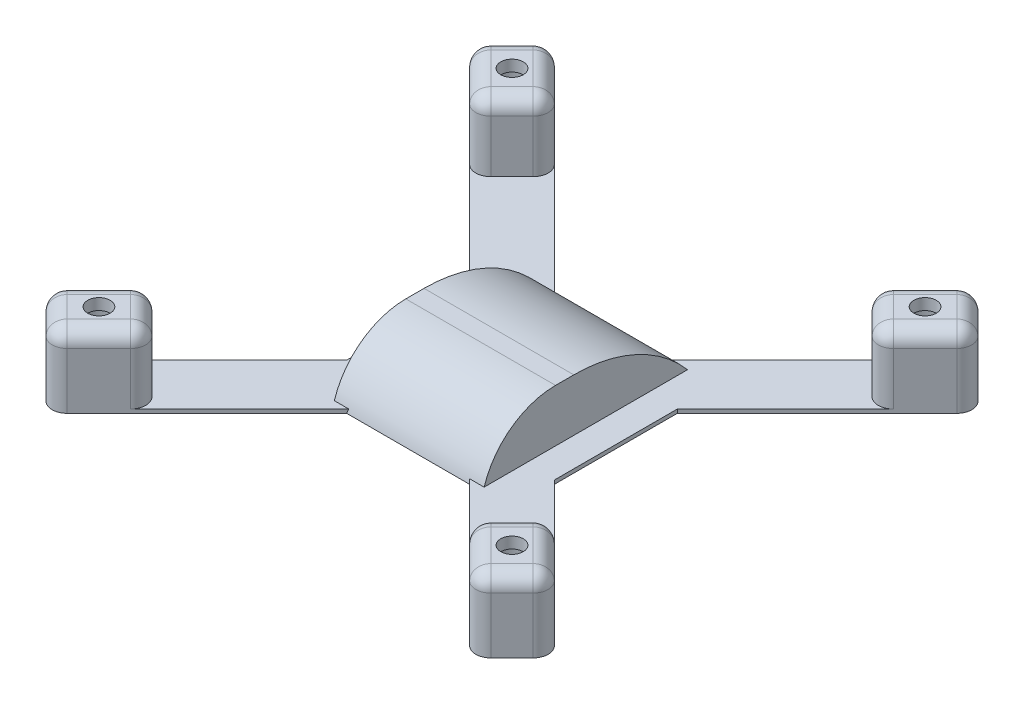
ISO-10303-21;
HEADER;
FILE_DESCRIPTION(('STEP AP214'),'2;1');
FILE_NAME('part.step','',(''),(''),'','','');
FILE_SCHEMA(('AUTOMOTIVE_DESIGN { 1 0 10303 214 1 1 1 1 }'));
ENDSEC;
DATA;
#1=APPLICATION_CONTEXT('core data for automotive mechanical design processes');
#2=APPLICATION_PROTOCOL_DEFINITION('international standard','automotive_design',2000,#1);
#3=PRODUCT_CONTEXT('',#1,'mechanical');
#4=PRODUCT('Part','Part','',(#3));
#5=PRODUCT_RELATED_PRODUCT_CATEGORY('part','',(#4));
#6=PRODUCT_DEFINITION_FORMATION('','',#4);
#7=PRODUCT_DEFINITION_CONTEXT('part definition',#1,'design');
#8=PRODUCT_DEFINITION('design','',#6,#7);
#9=PRODUCT_DEFINITION_SHAPE('','',#8);
#10=(LENGTH_UNIT() NAMED_UNIT(*) SI_UNIT(.MILLI.,.METRE.));
#11=(NAMED_UNIT(*) PLANE_ANGLE_UNIT() SI_UNIT($,.RADIAN.));
#12=(NAMED_UNIT(*) SI_UNIT($,.STERADIAN.) SOLID_ANGLE_UNIT());
#13=UNCERTAINTY_MEASURE_WITH_UNIT(LENGTH_MEASURE(1.E-05),#10,'distance_accuracy_value','');
#14=(GEOMETRIC_REPRESENTATION_CONTEXT(3) GLOBAL_UNCERTAINTY_ASSIGNED_CONTEXT((#13)) GLOBAL_UNIT_ASSIGNED_CONTEXT((#10,
#11,#12)) REPRESENTATION_CONTEXT('',''));
#15=CARTESIAN_POINT('',(0.,0.,0.));
#16=DIRECTION('',(0.,0.,1.));
#17=DIRECTION('',(1.,0.,0.));
#18=AXIS2_PLACEMENT_3D('',#15,#16,#17);
#19=CARTESIAN_POINT('',(0.,0.5,0.));
#20=DIRECTION('',(0.,-1.,0.));
#21=DIRECTION('',(0.,0.,-1.));
#22=AXIS2_PLACEMENT_3D('',#19,#20,#21);
#23=PLANE('',#22);
#24=DIRECTION('',(0.,0.,-1.));
#25=VECTOR('',#24,1.);
#26=CARTESIAN_POINT('',(10.,0.5,-13.865));
#27=LINE('',#26,#25);
#28=CARTESIAN_POINT('',(10.,0.5,13.7219336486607));
#29=VERTEX_POINT('',#28);
#30=CARTESIAN_POINT('',(10.,0.5,-13.4511891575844));
#31=VERTEX_POINT('',#30);
#32=EDGE_CURVE('E788',#29,#31,#27,.T.);
#33=ORIENTED_EDGE('',*,*,#32,.F.);
#34=DIRECTION('',(1.,0.,0.));
#35=VECTOR('',#34,1.);
#36=CARTESIAN_POINT('',(10.,0.5,13.7219336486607));
#37=LINE('',#36,#35);
#38=CARTESIAN_POINT('',(8.06507939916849,0.5,13.7219336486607));
#39=VERTEX_POINT('',#38);
#40=EDGE_CURVE('E1096',#29,#39,#37,.F.);
#41=ORIENTED_EDGE('',*,*,#40,.T.);
#42=DIRECTION('',(-0.707106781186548,0.,-0.707106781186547));
#43=VECTOR('',#42,1.);
#44=CARTESIAN_POINT('',(28.2842712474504,0.5,33.9411254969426));
#45=LINE('',#44,#43);
#46=CARTESIAN_POINT('',(22.627416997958,0.5,28.2842712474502));
#47=VERTEX_POINT('',#46);
#48=EDGE_CURVE('E501',#47,#39,#45,.T.);
#49=ORIENTED_EDGE('',*,*,#48,.F.);
#50=CARTESIAN_POINT('',(24.0416305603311,0.5,26.8700576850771));
#51=DIRECTION('',(0.,-1.,0.));
#52=DIRECTION('',(0.,0.,-1.));
#53=AXIS2_PLACEMENT_3D('',#50,#51,#52);
#54=CIRCLE('',#53,2.);
#55=CARTESIAN_POINT('',(22.627416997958,0.5,25.455844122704));
#56=VERTEX_POINT('',#55);
#57=EDGE_CURVE('E44',#47,#56,#54,.T.);
#58=ORIENTED_EDGE('',*,*,#57,.T.);
#59=DIRECTION('',(-0.707106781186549,0.,0.707106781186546));
#60=VECTOR('',#59,1.);
#61=CARTESIAN_POINT('',(24.041630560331,0.5,24.041630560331));
#62=LINE('',#61,#60);
#63=CARTESIAN_POINT('',(25.4558441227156,0.5,22.6274169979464));
#64=VERTEX_POINT('',#63);
#65=EDGE_CURVE('E776',#64,#56,#62,.T.);
#66=ORIENTED_EDGE('',*,*,#65,.F.);
#67=CARTESIAN_POINT('',(26.8700576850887,0.5,24.0416305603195));
#68=DIRECTION('',(0.,-1.,0.));
#69=DIRECTION('',(0.,0.,-1.));
#70=AXIS2_PLACEMENT_3D('',#67,#68,#69);
#71=CIRCLE('',#70,2.);
#72=CARTESIAN_POINT('',(28.2842712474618,0.5,22.6274169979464));
#73=VERTEX_POINT('',#72);
#74=EDGE_CURVE('E11',#64,#73,#71,.T.);
#75=ORIENTED_EDGE('',*,*,#74,.T.);
#76=DIRECTION('',(-0.707106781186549,0.,-0.707106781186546));
#77=VECTOR('',#76,1.);
#78=CARTESIAN_POINT('',(33.9411254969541,0.5,28.2842712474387));
#79=LINE('',#78,#77);
#80=CARTESIAN_POINT('',(13.865000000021,0.5,8.20814575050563));
#81=VERTEX_POINT('',#80);
#82=EDGE_CURVE('E381',#73,#81,#79,.T.);
#83=ORIENTED_EDGE('',*,*,#82,.T.);
#84=DIRECTION('',(0.,0.,-1.));
#85=VECTOR('',#84,1.);
#86=CARTESIAN_POINT('',(13.865000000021,0.5,8.20814575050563));
#87=LINE('',#86,#85);
#88=CARTESIAN_POINT('',(13.865000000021,0.5,-8.20814575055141));
#89=VERTEX_POINT('',#88);
#90=EDGE_CURVE('E376',#81,#89,#87,.T.);
#91=ORIENTED_EDGE('',*,*,#90,.T.);
#92=DIRECTION('',(-0.707106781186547,0.,0.707106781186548));
#93=VECTOR('',#92,1.);
#94=CARTESIAN_POINT('',(33.9411254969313,0.5,-28.2842712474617));
#95=LINE('',#94,#93);
#96=CARTESIAN_POINT('',(28.2842712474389,0.5,-22.6274169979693));
#97=VERTEX_POINT('',#96);
#98=EDGE_CURVE('E365',#97,#89,#95,.T.);
#99=ORIENTED_EDGE('',*,*,#98,.F.);
#100=CARTESIAN_POINT('',(26.8700576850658,0.5,-24.0416305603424));
#101=DIRECTION('',(0.,-1.,0.));
#102=DIRECTION('',(0.,0.,-1.));
#103=AXIS2_PLACEMENT_3D('',#100,#101,#102);
#104=CIRCLE('',#103,2.);
#105=CARTESIAN_POINT('',(25.4558441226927,0.5,-22.6274169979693));
#106=VERTEX_POINT('',#105);
#107=EDGE_CURVE('E602',#97,#106,#104,.T.);
#108=ORIENTED_EDGE('',*,*,#107,.T.);
#109=DIRECTION('',(-0.707106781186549,0.,-0.707106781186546));
#110=VECTOR('',#109,1.);
#111=CARTESIAN_POINT('',(24.041630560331,0.5,-24.041630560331));
#112=LINE('',#111,#110);
#113=CARTESIAN_POINT('',(22.627416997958,0.5,-25.455844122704));
#114=VERTEX_POINT('',#113);
#115=EDGE_CURVE('E492',#106,#114,#112,.T.);
#116=ORIENTED_EDGE('',*,*,#115,.T.);
#117=CARTESIAN_POINT('',(24.0416305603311,0.5,-26.8700576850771));
#118=DIRECTION('',(0.,-1.,0.));
#119=DIRECTION('',(0.,0.,-1.));
#120=AXIS2_PLACEMENT_3D('',#117,#118,#119);
#121=CIRCLE('',#120,2.);
#122=CARTESIAN_POINT('',(22.627416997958,0.5,-28.2842712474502));
#123=VERTEX_POINT('',#122);
#124=EDGE_CURVE('E604',#114,#123,#121,.T.);
#125=ORIENTED_EDGE('',*,*,#124,.T.);
#126=DIRECTION('',(-0.707106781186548,0.,0.707106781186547));
#127=VECTOR('',#126,1.);
#128=CARTESIAN_POINT('',(28.2842712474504,0.5,-33.9411254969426));
#129=LINE('',#128,#127);
#130=CARTESIAN_POINT('',(7.79433490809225,0.5,-13.4511891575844));
#131=VERTEX_POINT('',#130);
#132=EDGE_CURVE('E377',#123,#131,#129,.T.);
#133=ORIENTED_EDGE('',*,*,#132,.T.);
#134=DIRECTION('',(1.,0.,0.));
#135=VECTOR('',#134,1.);
#136=CARTESIAN_POINT('',(7.79433490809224,0.5,-13.4511891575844));
#137=LINE('',#136,#135);
#138=EDGE_CURVE('E1072',#131,#31,#137,.T.);
#139=ORIENTED_EDGE('',*,*,#138,.T.);
#140=EDGE_LOOP('',(#33,#41,#49,#58,#66,#75,#83,#91,#99,#108,#116,#125,#133,#139));
#141=FACE_BOUND('',#140,.T.);
#142=ADVANCED_FACE('F35',(#141),#23,.F.);
#143=DIRECTION('',(0.707106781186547,0.,-0.707106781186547));
#144=VECTOR('',#143,1.);
#145=CARTESIAN_POINT('',(-28.2842712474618,0.5,33.9411254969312));
#146=LINE('',#145,#144);
#147=CARTESIAN_POINT('',(-22.6274169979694,0.5,28.2842712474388));
#148=VERTEX_POINT('',#147);
#149=CARTESIAN_POINT('',(-8.06507939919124,0.5,13.7219336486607));
#150=VERTEX_POINT('',#149);
#151=EDGE_CURVE('E503',#148,#150,#146,.T.);
#152=ORIENTED_EDGE('',*,*,#151,.T.);
#153=DIRECTION('',(1.,0.,0.));
#154=VECTOR('',#153,1.);
#155=CARTESIAN_POINT('',(-8.06507939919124,0.5,13.7219336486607));
#156=LINE('',#155,#154);
#157=CARTESIAN_POINT('',(-10.,0.5,13.7219336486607));
#158=VERTEX_POINT('',#157);
#159=EDGE_CURVE('E1087',#150,#158,#156,.F.);
#160=ORIENTED_EDGE('',*,*,#159,.T.);
#161=DIRECTION('',(0.,0.,1.));
#162=VECTOR('',#161,1.);
#163=CARTESIAN_POINT('',(-10.,0.5,-13.865));
#164=LINE('',#163,#162);
#165=CARTESIAN_POINT('',(-10.,0.5,-13.4511891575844));
#166=VERTEX_POINT('',#165);
#167=EDGE_CURVE('E643',#166,#158,#164,.T.);
#168=ORIENTED_EDGE('',*,*,#167,.F.);
#169=DIRECTION('',(1.,0.,0.));
#170=VECTOR('',#169,1.);
#171=CARTESIAN_POINT('',(-10.,0.5,-13.4511891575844));
#172=LINE('',#171,#170);
#173=CARTESIAN_POINT('',(-7.79433490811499,0.5,-13.4511891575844));
#174=VERTEX_POINT('',#173);
#175=EDGE_CURVE('E1078',#166,#174,#172,.T.);
#176=ORIENTED_EDGE('',*,*,#175,.T.);
#177=DIRECTION('',(0.707106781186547,0.,0.707106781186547));
#178=VECTOR('',#177,1.);
#179=CARTESIAN_POINT('',(-28.2842712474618,0.5,-33.9411254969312));
#180=LINE('',#179,#178);
#181=CARTESIAN_POINT('',(-22.6274169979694,0.5,-28.2842712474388));
#182=VERTEX_POINT('',#181);
#183=EDGE_CURVE('E399',#182,#174,#180,.T.);
#184=ORIENTED_EDGE('',*,*,#183,.F.);
#185=CARTESIAN_POINT('',(-24.0416305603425,0.5,-26.8700576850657));
#186=DIRECTION('',(0.,-1.,0.));
#187=DIRECTION('',(0.,0.,-1.));
#188=AXIS2_PLACEMENT_3D('',#185,#186,#187);
#189=CIRCLE('',#188,2.);
#190=CARTESIAN_POINT('',(-22.6274169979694,0.5,-25.4558441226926));
#191=VERTEX_POINT('',#190);
#192=EDGE_CURVE('E600',#182,#191,#189,.T.);
#193=ORIENTED_EDGE('',*,*,#192,.T.);
#194=DIRECTION('',(0.707106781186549,0.,-0.707106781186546));
#195=VECTOR('',#194,1.);
#196=CARTESIAN_POINT('',(-24.041630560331,0.5,-24.041630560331));
#197=LINE('',#196,#195);
#198=CARTESIAN_POINT('',(-25.4558441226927,0.5,-22.6274169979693));
#199=VERTEX_POINT('',#198);
#200=EDGE_CURVE('E410',#199,#191,#197,.T.);
#201=ORIENTED_EDGE('',*,*,#200,.F.);
#202=CARTESIAN_POINT('',(-26.8700576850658,0.5,-24.0416305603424));
#203=DIRECTION('',(0.,-1.,0.));
#204=DIRECTION('',(0.,0.,-1.));
#205=AXIS2_PLACEMENT_3D('',#202,#203,#204);
#206=CIRCLE('',#205,2.);
#207=CARTESIAN_POINT('',(-28.2842712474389,0.5,-22.6274169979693));
#208=VERTEX_POINT('',#207);
#209=EDGE_CURVE('E509',#199,#208,#206,.T.);
#210=ORIENTED_EDGE('',*,*,#209,.T.);
#211=DIRECTION('',(0.707106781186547,0.,0.707106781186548));
#212=VECTOR('',#211,1.);
#213=CARTESIAN_POINT('',(-33.9411254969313,0.5,-28.2842712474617));
#214=LINE('',#213,#212);
#215=CARTESIAN_POINT('',(-13.865000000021,0.5,-8.20814575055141));
#216=VERTEX_POINT('',#215);
#217=EDGE_CURVE('E390',#208,#216,#214,.T.);
#218=ORIENTED_EDGE('',*,*,#217,.T.);
#219=DIRECTION('',(0.,0.,-1.));
#220=VECTOR('',#219,1.);
#221=CARTESIAN_POINT('',(-13.865000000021,0.5,8.20814575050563));
#222=LINE('',#221,#220);
#223=CARTESIAN_POINT('',(-13.865000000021,0.5,8.20814575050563));
#224=VERTEX_POINT('',#223);
#225=EDGE_CURVE('E394',#224,#216,#222,.T.);
#226=ORIENTED_EDGE('',*,*,#225,.F.);
#227=DIRECTION('',(0.707106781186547,0.,-0.707106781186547));
#228=VECTOR('',#227,1.);
#229=CARTESIAN_POINT('',(-33.9411254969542,0.5,28.2842712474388));
#230=LINE('',#229,#228);
#231=CARTESIAN_POINT('',(-28.2842712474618,0.5,22.6274169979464));
#232=VERTEX_POINT('',#231);
#233=EDGE_CURVE('E455',#232,#224,#230,.T.);
#234=ORIENTED_EDGE('',*,*,#233,.F.);
#235=CARTESIAN_POINT('',(-26.8700576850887,0.5,24.0416305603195));
#236=DIRECTION('',(0.,-1.,0.));
#237=DIRECTION('',(0.,0.,-1.));
#238=AXIS2_PLACEMENT_3D('',#235,#236,#237);
#239=CIRCLE('',#238,2.);
#240=CARTESIAN_POINT('',(-25.4558441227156,0.5,22.6274169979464));
#241=VERTEX_POINT('',#240);
#242=EDGE_CURVE('E594',#232,#241,#239,.T.);
#243=ORIENTED_EDGE('',*,*,#242,.T.);
#244=DIRECTION('',(0.707106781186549,0.,0.707106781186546));
#245=VECTOR('',#244,1.);
#246=CARTESIAN_POINT('',(-24.041630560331,0.5,24.041630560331));
#247=LINE('',#246,#245);
#248=CARTESIAN_POINT('',(-22.6274169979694,0.5,25.4558441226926));
#249=VERTEX_POINT('',#248);
#250=EDGE_CURVE('E782',#241,#249,#247,.T.);
#251=ORIENTED_EDGE('',*,*,#250,.T.);
#252=CARTESIAN_POINT('',(-24.0416305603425,0.5,26.8700576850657));
#253=DIRECTION('',(0.,-1.,0.));
#254=DIRECTION('',(0.,0.,-1.));
#255=AXIS2_PLACEMENT_3D('',#252,#253,#254);
#256=CIRCLE('',#255,2.);
#257=EDGE_CURVE('E596',#249,#148,#256,.T.);
#258=ORIENTED_EDGE('',*,*,#257,.T.);
#259=EDGE_LOOP('',(#152,#160,#168,#176,#184,#193,#201,#210,#218,#226,#234,#243,#251,#258));
#260=FACE_BOUND('',#259,.T.);
#261=ADVANCED_FACE('F505',(#260),#23,.F.);
#262=CARTESIAN_POINT('',(-33.9411254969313,0.5,-28.2842712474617));
#263=DIRECTION('',(-0.707106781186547,0.,-0.707106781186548));
#264=DIRECTION('',(-0.707106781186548,0.,0.707106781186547));
#265=AXIS2_PLACEMENT_3D('',#262,#263,#264);
#266=PLANE('',#265);
#267=DIRECTION('',(0.707106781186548,0.,-0.707106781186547));
#268=VECTOR('',#267,1.);
#269=CARTESIAN_POINT('',(-33.9411254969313,0.,-28.2842712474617));
#270=LINE('',#269,#268);
#271=CARTESIAN_POINT('',(-32.5269119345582,0.,-29.6984848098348));
#272=VERTEX_POINT('',#271);
#273=CARTESIAN_POINT('',(-29.6984848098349,0.,-32.5269119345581));
#274=VERTEX_POINT('',#273);
#275=EDGE_CURVE('E406',#272,#274,#270,.T.);
#276=ORIENTED_EDGE('',*,*,#275,.F.);
#277=DIRECTION('',(0.,-1.,0.));
#278=VECTOR('',#277,1.);
#279=CARTESIAN_POINT('',(-32.5269119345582,9.5,-29.6984848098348));
#280=LINE('',#279,#278);
#281=CARTESIAN_POINT('',(-32.5269119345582,7.5,-29.6984848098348));
#282=VERTEX_POINT('',#281);
#283=EDGE_CURVE('E520',#272,#282,#280,.F.);
#284=ORIENTED_EDGE('',*,*,#283,.T.);
#285=DIRECTION('',(-0.707106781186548,0.,0.707106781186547));
#286=VECTOR('',#285,1.);
#287=CARTESIAN_POINT('',(-33.9411254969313,7.5,-28.2842712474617));
#288=LINE('',#287,#286);
#289=CARTESIAN_POINT('',(-29.6984848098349,7.5,-32.5269119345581));
#290=VERTEX_POINT('',#289);
#291=EDGE_CURVE('E524',#282,#290,#288,.F.);
#292=ORIENTED_EDGE('',*,*,#291,.T.);
#293=DIRECTION('',(0.,-1.,0.));
#294=VECTOR('',#293,1.);
#295=CARTESIAN_POINT('',(-29.6984848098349,0.5,-32.5269119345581));
#296=LINE('',#295,#294);
#297=EDGE_CURVE('E1004',#290,#274,#296,.T.);
#298=ORIENTED_EDGE('',*,*,#297,.T.);
#299=EDGE_LOOP('',(#276,#284,#292,#298));
#300=FACE_BOUND('',#299,.T.);
#301=ADVANCED_FACE('F883',(#300),#266,.T.);
#302=CARTESIAN_POINT('',(-33.9411254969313,0.5,-28.2842712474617));
#303=DIRECTION('',(0.707106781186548,0.,-0.707106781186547));
#304=DIRECTION('',(-0.707106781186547,0.,-0.707106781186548));
#305=AXIS2_PLACEMENT_3D('',#302,#303,#304);
#306=PLANE('',#305);
#307=ORIENTED_EDGE('',*,*,#217,.F.);
#308=DIRECTION('',(0.,-1.,0.));
#309=VECTOR('',#308,1.);
#310=CARTESIAN_POINT('',(-28.2842712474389,0.5,-22.6274169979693));
#311=LINE('',#310,#309);
#312=CARTESIAN_POINT('',(-28.2842712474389,7.5,-22.6274169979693));
#313=VERTEX_POINT('',#312);
#314=EDGE_CURVE('E522',#208,#313,#311,.F.);
#315=ORIENTED_EDGE('',*,*,#314,.T.);
#316=DIRECTION('',(0.707106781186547,0.,0.707106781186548));
#317=VECTOR('',#316,1.);
#318=CARTESIAN_POINT('',(-33.9411254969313,7.5,-28.2842712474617));
#319=LINE('',#318,#317);
#320=CARTESIAN_POINT('',(-32.5269119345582,7.5,-26.8700576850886));
#321=VERTEX_POINT('',#320);
#322=EDGE_CURVE('E516',#313,#321,#319,.F.);
#323=ORIENTED_EDGE('',*,*,#322,.T.);
#324=DIRECTION('',(0.,-1.,0.));
#325=VECTOR('',#324,1.);
#326=CARTESIAN_POINT('',(-32.5269119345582,0.,-26.8700576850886));
#327=LINE('',#326,#325);
#328=CARTESIAN_POINT('',(-32.5269119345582,0.,-26.8700576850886));
#329=VERTEX_POINT('',#328);
#330=EDGE_CURVE('E514',#321,#329,#327,.T.);
#331=ORIENTED_EDGE('',*,*,#330,.T.);
#332=DIRECTION('',(0.707106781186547,0.,0.707106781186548));
#333=VECTOR('',#332,1.);
#334=CARTESIAN_POINT('',(-33.9411254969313,0.,-28.2842712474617));
#335=LINE('',#334,#333);
#336=CARTESIAN_POINT('',(-13.865000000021,0.,-8.20814575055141));
#337=VERTEX_POINT('',#336);
#338=EDGE_CURVE('E442',#329,#337,#335,.T.);
#339=ORIENTED_EDGE('',*,*,#338,.T.);
#340=DIRECTION('',(0.,-1.,0.));
#341=VECTOR('',#340,1.);
#342=CARTESIAN_POINT('',(-13.865000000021,0.5,-8.20814575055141));
#343=LINE('',#342,#341);
#344=EDGE_CURVE('E444',#216,#337,#343,.T.);
#345=ORIENTED_EDGE('',*,*,#344,.F.);
#346=EDGE_LOOP('',(#307,#315,#323,#331,#339,#345));
#347=FACE_BOUND('',#346,.T.);
#348=ADVANCED_FACE('F512',(#347),#306,.F.);
#349=CARTESIAN_POINT('',(-13.865000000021,0.5,8.20814575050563));
#350=DIRECTION('',(-1.,0.,0.));
#351=DIRECTION('',(0.,0.,1.));
#352=AXIS2_PLACEMENT_3D('',#349,#350,#351);
#353=PLANE('',#352);
#354=DIRECTION('',(0.,0.,-1.));
#355=VECTOR('',#354,1.);
#356=CARTESIAN_POINT('',(-13.865000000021,0.,8.20814575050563));
#357=LINE('',#356,#355);
#358=CARTESIAN_POINT('',(-13.865000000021,0.,8.20814575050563));
#359=VERTEX_POINT('',#358);
#360=EDGE_CURVE('E439',#359,#337,#357,.T.);
#361=ORIENTED_EDGE('',*,*,#360,.F.);
#362=DIRECTION('',(0.,-1.,0.));
#363=VECTOR('',#362,1.);
#364=CARTESIAN_POINT('',(-13.865000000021,0.5,8.20814575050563));
#365=LINE('',#364,#363);
#366=EDGE_CURVE('E392',#224,#359,#365,.T.);
#367=ORIENTED_EDGE('',*,*,#366,.F.);
#368=ORIENTED_EDGE('',*,*,#225,.T.);
#369=ORIENTED_EDGE('',*,*,#344,.T.);
#370=EDGE_LOOP('',(#361,#367,#368,#369));
#371=FACE_BOUND('',#370,.T.);
#372=ADVANCED_FACE('F459',(#371),#353,.T.);
#373=CARTESIAN_POINT('',(-33.9411254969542,0.5,28.2842712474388));
#374=DIRECTION('',(-0.707106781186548,0.,-0.707106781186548));
#375=DIRECTION('',(-0.707106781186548,0.,0.707106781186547));
#376=AXIS2_PLACEMENT_3D('',#373,#374,#375);
#377=PLANE('',#376);
#378=DIRECTION('',(0.,-1.,0.));
#379=VECTOR('',#378,1.);
#380=CARTESIAN_POINT('',(-28.2842712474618,0.5,22.6274169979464));
#381=LINE('',#380,#379);
#382=CARTESIAN_POINT('',(-28.2842712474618,7.5,22.6274169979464));
#383=VERTEX_POINT('',#382);
#384=EDGE_CURVE('E1038',#383,#232,#381,.T.);
#385=ORIENTED_EDGE('',*,*,#384,.T.);
#386=ORIENTED_EDGE('',*,*,#233,.T.);
#387=ORIENTED_EDGE('',*,*,#366,.T.);
#388=DIRECTION('',(0.707106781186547,0.,-0.707106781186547));
#389=VECTOR('',#388,1.);
#390=CARTESIAN_POINT('',(-33.9411254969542,0.,28.2842712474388));
#391=LINE('',#390,#389);
#392=CARTESIAN_POINT('',(-32.5269119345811,0.,26.8700576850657));
#393=VERTEX_POINT('',#392);
#394=EDGE_CURVE('E437',#393,#359,#391,.T.);
#395=ORIENTED_EDGE('',*,*,#394,.F.);
#396=DIRECTION('',(0.,-1.,0.));
#397=VECTOR('',#396,1.);
#398=CARTESIAN_POINT('',(-32.5269119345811,9.5,26.8700576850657));
#399=LINE('',#398,#397);
#400=CARTESIAN_POINT('',(-32.5269119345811,7.5,26.8700576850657));
#401=VERTEX_POINT('',#400);
#402=EDGE_CURVE('E1042',#393,#401,#399,.F.);
#403=ORIENTED_EDGE('',*,*,#402,.T.);
#404=DIRECTION('',(-0.707106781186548,0.,0.707106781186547));
#405=VECTOR('',#404,1.);
#406=CARTESIAN_POINT('',(-33.9411254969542,7.5,28.2842712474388));
#407=LINE('',#406,#405);
#408=EDGE_CURVE('E1040',#401,#383,#407,.F.);
#409=ORIENTED_EDGE('',*,*,#408,.T.);
#410=EDGE_LOOP('',(#385,#386,#387,#395,#403,#409));
#411=FACE_BOUND('',#410,.T.);
#412=ADVANCED_FACE('F453',(#411),#377,.T.);
#413=CARTESIAN_POINT('',(-33.9411254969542,0.5,28.2842712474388));
#414=DIRECTION('',(0.707106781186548,0.,-0.707106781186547));
#415=DIRECTION('',(-0.707106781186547,0.,-0.707106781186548));
#416=AXIS2_PLACEMENT_3D('',#413,#414,#415);
#417=PLANE('',#416);
#418=DIRECTION('',(0.707106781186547,0.,0.707106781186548));
#419=VECTOR('',#418,1.);
#420=CARTESIAN_POINT('',(-33.9411254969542,0.,28.2842712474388));
#421=LINE('',#420,#419);
#422=CARTESIAN_POINT('',(-32.5269119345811,0.,29.6984848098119));
#423=VERTEX_POINT('',#422);
#424=CARTESIAN_POINT('',(-29.6984848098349,0.,32.5269119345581));
#425=VERTEX_POINT('',#424);
#426=EDGE_CURVE('E434',#423,#425,#421,.T.);
#427=ORIENTED_EDGE('',*,*,#426,.T.);
#428=DIRECTION('',(0.,-1.,0.));
#429=VECTOR('',#428,1.);
#430=CARTESIAN_POINT('',(-29.6984848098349,0.5,32.5269119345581));
#431=LINE('',#430,#429);
#432=CARTESIAN_POINT('',(-29.6984848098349,7.5,32.5269119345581));
#433=VERTEX_POINT('',#432);
#434=EDGE_CURVE('E1044',#425,#433,#431,.F.);
#435=ORIENTED_EDGE('',*,*,#434,.T.);
#436=DIRECTION('',(0.707106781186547,0.,0.707106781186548));
#437=VECTOR('',#436,1.);
#438=CARTESIAN_POINT('',(-33.9411254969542,7.5,28.2842712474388));
#439=LINE('',#438,#437);
#440=CARTESIAN_POINT('',(-32.5269119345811,7.5,29.6984848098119));
#441=VERTEX_POINT('',#440);
#442=EDGE_CURVE('E1046',#433,#441,#439,.F.);
#443=ORIENTED_EDGE('',*,*,#442,.T.);
#444=DIRECTION('',(0.,-1.,0.));
#445=VECTOR('',#444,1.);
#446=CARTESIAN_POINT('',(-32.5269119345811,0.,29.6984848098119));
#447=LINE('',#446,#445);
#448=EDGE_CURVE('E1048',#441,#423,#447,.T.);
#449=ORIENTED_EDGE('',*,*,#448,.T.);
#450=EDGE_LOOP('',(#427,#435,#443,#449));
#451=FACE_BOUND('',#450,.T.);
#452=ADVANCED_FACE('F1806',(#451),#417,.F.);
#453=CARTESIAN_POINT('',(-28.2842712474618,0.5,33.9411254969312));
#454=DIRECTION('',(-0.707106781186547,0.,-0.707106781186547));
#455=DIRECTION('',(-0.707106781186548,0.,0.707106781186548));
#456=AXIS2_PLACEMENT_3D('',#453,#454,#455);
#457=PLANE('',#456);
#458=ORIENTED_EDGE('',*,*,#151,.F.);
#459=DIRECTION('',(0.,-1.,0.));
#460=VECTOR('',#459,1.);
#461=CARTESIAN_POINT('',(-22.6274169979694,9.5,28.2842712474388));
#462=LINE('',#461,#460);
#463=CARTESIAN_POINT('',(-22.6274169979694,7.5,28.2842712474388));
#464=VERTEX_POINT('',#463);
#465=EDGE_CURVE('E1050',#148,#464,#462,.F.);
#466=ORIENTED_EDGE('',*,*,#465,.T.);
#467=DIRECTION('',(0.707106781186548,0.,-0.707106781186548));
#468=VECTOR('',#467,1.);
#469=CARTESIAN_POINT('',(-28.2842712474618,7.5,33.9411254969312));
#470=LINE('',#469,#468);
#471=CARTESIAN_POINT('',(-26.8700576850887,7.5,32.5269119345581));
#472=VERTEX_POINT('',#471);
#473=EDGE_CURVE('E1052',#464,#472,#470,.F.);
#474=ORIENTED_EDGE('',*,*,#473,.T.);
#475=DIRECTION('',(0.,-1.,0.));
#476=VECTOR('',#475,1.);
#477=CARTESIAN_POINT('',(-26.8700576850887,0.5,32.5269119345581));
#478=LINE('',#477,#476);
#479=CARTESIAN_POINT('',(-26.8700576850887,0.,32.5269119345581));
#480=VERTEX_POINT('',#479);
#481=EDGE_CURVE('E1054',#472,#480,#478,.T.);
#482=ORIENTED_EDGE('',*,*,#481,.T.);
#483=DIRECTION('',(0.707106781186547,0.,-0.707106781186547));
#484=VECTOR('',#483,1.);
#485=CARTESIAN_POINT('',(-28.2842712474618,0.,33.9411254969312));
#486=LINE('',#485,#484);
#487=CARTESIAN_POINT('',(-8.20814575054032,0.,13.8650000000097));
#488=VERTEX_POINT('',#487);
#489=EDGE_CURVE('E432',#480,#488,#486,.T.);
#490=ORIENTED_EDGE('',*,*,#489,.T.);
#491=CARTESIAN_POINT('',(1.47431261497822,-2.5,4.1825416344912));
#492=DIRECTION('',(-0.707106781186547,0.,-0.707106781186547));
#493=DIRECTION('',(0.707106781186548,0.,-0.707106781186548));
#494=AXIS2_PLACEMENT_3D('',#491,#492,#493);
#495=ELLIPSE('',#494,14.142135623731,10.);
#496=EDGE_CURVE('E1090',#488,#150,#495,.T.);
#497=ORIENTED_EDGE('',*,*,#496,.T.);
#498=EDGE_LOOP('',(#458,#466,#474,#482,#490,#497));
#499=FACE_BOUND('',#498,.T.);
#500=ADVANCED_FACE('F1121',(#499),#457,.F.);
#501=CARTESIAN_POINT('',(28.2842712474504,0.5,33.9411254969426));
#502=DIRECTION('',(-0.707106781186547,0.,0.707106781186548));
#503=DIRECTION('',(0.707106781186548,0.,0.707106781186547));
#504=AXIS2_PLACEMENT_3D('',#501,#502,#503);
#505=PLANE('',#504);
#506=DIRECTION('',(-0.707106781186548,0.,-0.707106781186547));
#507=VECTOR('',#506,1.);
#508=CARTESIAN_POINT('',(28.2842712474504,0.,33.9411254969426));
#509=LINE('',#508,#507);
#510=CARTESIAN_POINT('',(26.8700576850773,0.,32.5269119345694));
#511=VERTEX_POINT('',#510);
#512=CARTESIAN_POINT('',(8.20814575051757,0.,13.8650000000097));
#513=VERTEX_POINT('',#512);
#514=EDGE_CURVE('E427',#511,#513,#509,.T.);
#515=ORIENTED_EDGE('',*,*,#514,.F.);
#516=DIRECTION('',(0.,-1.,0.));
#517=VECTOR('',#516,1.);
#518=CARTESIAN_POINT('',(26.8700576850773,9.5,32.5269119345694));
#519=LINE('',#518,#517);
#520=CARTESIAN_POINT('',(26.8700576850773,7.5,32.5269119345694));
#521=VERTEX_POINT('',#520);
#522=EDGE_CURVE('E588',#511,#521,#519,.F.);
#523=ORIENTED_EDGE('',*,*,#522,.T.);
#524=DIRECTION('',(0.707106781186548,0.,0.707106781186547));
#525=VECTOR('',#524,1.);
#526=CARTESIAN_POINT('',(28.2842712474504,7.5,33.9411254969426));
#527=LINE('',#526,#525);
#528=CARTESIAN_POINT('',(22.627416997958,7.5,28.2842712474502));
#529=VERTEX_POINT('',#528);
#530=EDGE_CURVE('E586',#521,#529,#527,.F.);
#531=ORIENTED_EDGE('',*,*,#530,.T.);
#532=DIRECTION('',(0.,-1.,0.));
#533=VECTOR('',#532,1.);
#534=CARTESIAN_POINT('',(22.627416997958,0.5,28.2842712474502));
#535=LINE('',#534,#533);
#536=EDGE_CURVE('E583',#529,#47,#535,.T.);
#537=ORIENTED_EDGE('',*,*,#536,.T.);
#538=ORIENTED_EDGE('',*,*,#48,.T.);
#539=CARTESIAN_POINT('',(-1.47431261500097,-2.5,4.1825416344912));
#540=DIRECTION('',(-0.707106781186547,0.,0.707106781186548));
#541=DIRECTION('',(0.707106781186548,0.,0.707106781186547));
#542=AXIS2_PLACEMENT_3D('',#539,#540,#541);
#543=ELLIPSE('',#542,14.142135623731,10.);
#544=EDGE_CURVE('E1093',#39,#513,#543,.F.);
#545=ORIENTED_EDGE('',*,*,#544,.T.);
#546=EDGE_LOOP('',(#515,#523,#531,#537,#538,#545));
#547=FACE_BOUND('',#546,.T.);
#548=ADVANCED_FACE('F767',(#547),#505,.T.);
#549=CARTESIAN_POINT('',(28.2842712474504,0.5,33.9411254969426));
#550=DIRECTION('',(-0.707106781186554,0.,-0.707106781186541));
#551=DIRECTION('',(-0.707106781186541,0.,0.707106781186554));
#552=AXIS2_PLACEMENT_3D('',#549,#550,#551);
#553=PLANE('',#552);
#554=DIRECTION('',(0.707106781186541,0.,-0.707106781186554));
#555=VECTOR('',#554,1.);
#556=CARTESIAN_POINT('',(28.2842712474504,7.5,33.9411254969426));
#557=LINE('',#556,#555);
#558=CARTESIAN_POINT('',(32.5269119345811,7.5,29.6984848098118));
#559=VERTEX_POINT('',#558);
#560=CARTESIAN_POINT('',(29.6984848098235,7.5,32.5269119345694));
#561=VERTEX_POINT('',#560);
#562=EDGE_CURVE('E52',#559,#561,#557,.F.);
#563=ORIENTED_EDGE('',*,*,#562,.T.);
#564=DIRECTION('',(0.,-1.,0.));
#565=VECTOR('',#564,1.);
#566=CARTESIAN_POINT('',(29.6984848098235,0.,32.5269119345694));
#567=LINE('',#566,#565);
#568=CARTESIAN_POINT('',(29.6984848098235,0.,32.5269119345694));
#569=VERTEX_POINT('',#568);
#570=EDGE_CURVE('E592',#561,#569,#567,.T.);
#571=ORIENTED_EDGE('',*,*,#570,.T.);
#572=DIRECTION('',(0.707106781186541,0.,-0.707106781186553));
#573=VECTOR('',#572,1.);
#574=CARTESIAN_POINT('',(28.2842712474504,0.,33.9411254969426));
#575=LINE('',#574,#573);
#576=CARTESIAN_POINT('',(32.5269119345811,0.,29.6984848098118));
#577=VERTEX_POINT('',#576);
#578=EDGE_CURVE('E425',#569,#577,#575,.T.);
#579=ORIENTED_EDGE('',*,*,#578,.T.);
#580=DIRECTION('',(0.,-1.,0.));
#581=VECTOR('',#580,1.);
#582=CARTESIAN_POINT('',(32.5269119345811,0.5,29.6984848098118));
#583=LINE('',#582,#581);
#584=EDGE_CURVE('E57',#577,#559,#583,.F.);
#585=ORIENTED_EDGE('',*,*,#584,.T.);
#586=EDGE_LOOP('',(#563,#571,#579,#585));
#587=FACE_BOUND('',#586,.T.);
#588=ADVANCED_FACE('F1243',(#587),#553,.F.);
#589=CARTESIAN_POINT('',(33.9411254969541,0.5,28.2842712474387));
#590=DIRECTION('',(-0.707106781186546,0.,0.707106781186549));
#591=DIRECTION('',(0.707106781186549,0.,0.707106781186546));
#592=AXIS2_PLACEMENT_3D('',#589,#590,#591);
#593=PLANE('',#592);
#594=DIRECTION('',(-0.707106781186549,0.,-0.707106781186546));
#595=VECTOR('',#594,1.);
#596=CARTESIAN_POINT('',(33.9411254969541,7.5,28.2842712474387));
#597=LINE('',#596,#595);
#598=CARTESIAN_POINT('',(28.2842712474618,7.5,22.6274169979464));
#599=VERTEX_POINT('',#598);
#600=CARTESIAN_POINT('',(32.526911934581,7.5,26.8700576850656));
#601=VERTEX_POINT('',#600);
#602=EDGE_CURVE('E572',#599,#601,#597,.F.);
#603=ORIENTED_EDGE('',*,*,#602,.T.);
#604=DIRECTION('',(0.,-1.,0.));
#605=VECTOR('',#604,1.);
#606=CARTESIAN_POINT('',(32.526911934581,0.5,26.8700576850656));
#607=LINE('',#606,#605);
#608=CARTESIAN_POINT('',(32.526911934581,0.,26.8700576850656));
#609=VERTEX_POINT('',#608);
#610=EDGE_CURVE('E575',#601,#609,#607,.T.);
#611=ORIENTED_EDGE('',*,*,#610,.T.);
#612=DIRECTION('',(-0.707106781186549,0.,-0.707106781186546));
#613=VECTOR('',#612,1.);
#614=CARTESIAN_POINT('',(33.9411254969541,0.,28.2842712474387));
#615=LINE('',#614,#613);
#616=CARTESIAN_POINT('',(13.865000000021,0.,8.20814575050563));
#617=VERTEX_POINT('',#616);
#618=EDGE_CURVE('E423',#609,#617,#615,.T.);
#619=ORIENTED_EDGE('',*,*,#618,.T.);
#620=DIRECTION('',(0.,-1.,0.));
#621=VECTOR('',#620,1.);
#622=CARTESIAN_POINT('',(13.865000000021,0.5,8.20814575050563));
#623=LINE('',#622,#621);
#624=EDGE_CURVE('E389',#81,#617,#623,.T.);
#625=ORIENTED_EDGE('',*,*,#624,.F.);
#626=ORIENTED_EDGE('',*,*,#82,.F.);
#627=DIRECTION('',(0.,-1.,0.));
#628=VECTOR('',#627,1.);
#629=CARTESIAN_POINT('',(28.2842712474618,0.5,22.6274169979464));
#630=LINE('',#629,#628);
#631=EDGE_CURVE('E570',#73,#599,#630,.F.);
#632=ORIENTED_EDGE('',*,*,#631,.T.);
#633=EDGE_LOOP('',(#603,#611,#619,#625,#626,#632));
#634=FACE_BOUND('',#633,.T.);
#635=ADVANCED_FACE('F1252',(#634),#593,.F.);
#636=CARTESIAN_POINT('',(13.865000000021,0.5,8.20814575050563));
#637=DIRECTION('',(-1.,0.,0.));
#638=DIRECTION('',(0.,0.,1.));
#639=AXIS2_PLACEMENT_3D('',#636,#637,#638);
#640=PLANE('',#639);
#641=DIRECTION('',(0.,0.,-1.));
#642=VECTOR('',#641,1.);
#643=CARTESIAN_POINT('',(13.865000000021,0.,8.20814575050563));
#644=LINE('',#643,#642);
#645=CARTESIAN_POINT('',(13.865000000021,0.,-8.20814575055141));
#646=VERTEX_POINT('',#645);
#647=EDGE_CURVE('E388',#617,#646,#644,.T.);
#648=ORIENTED_EDGE('',*,*,#647,.T.);
#649=DIRECTION('',(0.,-1.,0.));
#650=VECTOR('',#649,1.);
#651=CARTESIAN_POINT('',(13.865000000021,0.5,-8.20814575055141));
#652=LINE('',#651,#650);
#653=EDGE_CURVE('E370',#89,#646,#652,.T.);
#654=ORIENTED_EDGE('',*,*,#653,.F.);
#655=ORIENTED_EDGE('',*,*,#90,.F.);
#656=ORIENTED_EDGE('',*,*,#624,.T.);
#657=EDGE_LOOP('',(#648,#654,#655,#656));
#658=FACE_BOUND('',#657,.T.);
#659=ADVANCED_FACE('F386',(#658),#640,.F.);
#660=CARTESIAN_POINT('',(33.9411254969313,0.5,-28.2842712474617));
#661=DIRECTION('',(0.707106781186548,0.,0.707106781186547));
#662=DIRECTION('',(0.707106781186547,0.,-0.707106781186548));
#663=AXIS2_PLACEMENT_3D('',#660,#661,#662);
#664=PLANE('',#663);
#665=DIRECTION('',(0.,-1.,0.));
#666=VECTOR('',#665,1.);
#667=CARTESIAN_POINT('',(28.2842712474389,0.5,-22.6274169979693));
#668=LINE('',#667,#666);
#669=CARTESIAN_POINT('',(28.2842712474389,7.5,-22.6274169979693));
#670=VERTEX_POINT('',#669);
#671=EDGE_CURVE('E373',#670,#97,#668,.T.);
#672=ORIENTED_EDGE('',*,*,#671,.T.);
#673=ORIENTED_EDGE('',*,*,#98,.T.);
#674=ORIENTED_EDGE('',*,*,#653,.T.);
#675=DIRECTION('',(-0.707106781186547,0.,0.707106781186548));
#676=VECTOR('',#675,1.);
#677=CARTESIAN_POINT('',(33.9411254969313,0.,-28.2842712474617));
#678=LINE('',#677,#676);
#679=CARTESIAN_POINT('',(32.5269119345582,0.,-26.8700576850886));
#680=VERTEX_POINT('',#679);
#681=EDGE_CURVE('E420',#680,#646,#678,.T.);
#682=ORIENTED_EDGE('',*,*,#681,.F.);
#683=DIRECTION('',(0.,-1.,0.));
#684=VECTOR('',#683,1.);
#685=CARTESIAN_POINT('',(32.5269119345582,0.5,-26.8700576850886));
#686=LINE('',#685,#684);
#687=CARTESIAN_POINT('',(32.5269119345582,7.5,-26.8700576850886));
#688=VERTEX_POINT('',#687);
#689=EDGE_CURVE('E529',#680,#688,#686,.F.);
#690=ORIENTED_EDGE('',*,*,#689,.T.);
#691=DIRECTION('',(0.707106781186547,0.,-0.707106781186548));
#692=VECTOR('',#691,1.);
#693=CARTESIAN_POINT('',(33.9411254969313,7.5,-28.2842712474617));
#694=LINE('',#693,#692);
#695=EDGE_CURVE('E531',#688,#670,#694,.F.);
#696=ORIENTED_EDGE('',*,*,#695,.T.);
#697=EDGE_LOOP('',(#672,#673,#674,#682,#690,#696));
#698=FACE_BOUND('',#697,.T.);
#699=ADVANCED_FACE('F367',(#698),#664,.T.);
#700=CARTESIAN_POINT('',(28.2842712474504,0.5,-33.9411254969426));
#701=DIRECTION('',(0.707106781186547,0.,-0.707106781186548));
#702=DIRECTION('',(-0.707106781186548,0.,-0.707106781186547));
#703=AXIS2_PLACEMENT_3D('',#700,#701,#702);
#704=PLANE('',#703);
#705=DIRECTION('',(0.707106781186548,0.,0.707106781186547));
#706=VECTOR('',#705,1.);
#707=CARTESIAN_POINT('',(28.2842712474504,0.,-33.9411254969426));
#708=LINE('',#707,#706);
#709=CARTESIAN_POINT('',(29.6984848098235,0.,-32.5269119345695));
#710=VERTEX_POINT('',#709);
#711=CARTESIAN_POINT('',(32.5269119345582,0.,-29.6984848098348));
#712=VERTEX_POINT('',#711);
#713=EDGE_CURVE('E417',#710,#712,#708,.T.);
#714=ORIENTED_EDGE('',*,*,#713,.F.);
#715=DIRECTION('',(0.,-1.,0.));
#716=VECTOR('',#715,1.);
#717=CARTESIAN_POINT('',(29.6984848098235,9.5,-32.5269119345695));
#718=LINE('',#717,#716);
#719=CARTESIAN_POINT('',(29.6984848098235,7.5,-32.5269119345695));
#720=VERTEX_POINT('',#719);
#721=EDGE_CURVE('E559',#710,#720,#718,.F.);
#722=ORIENTED_EDGE('',*,*,#721,.T.);
#723=DIRECTION('',(-0.707106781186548,0.,-0.707106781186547));
#724=VECTOR('',#723,1.);
#725=CARTESIAN_POINT('',(28.2842712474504,7.5,-33.9411254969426));
#726=LINE('',#725,#724);
#727=CARTESIAN_POINT('',(32.5269119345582,7.5,-29.6984848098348));
#728=VERTEX_POINT('',#727);
#729=EDGE_CURVE('E557',#720,#728,#726,.F.);
#730=ORIENTED_EDGE('',*,*,#729,.T.);
#731=DIRECTION('',(0.,-1.,0.));
#732=VECTOR('',#731,1.);
#733=CARTESIAN_POINT('',(32.5269119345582,0.5,-29.6984848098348));
#734=LINE('',#733,#732);
#735=EDGE_CURVE('E555',#728,#712,#734,.T.);
#736=ORIENTED_EDGE('',*,*,#735,.T.);
#737=EDGE_LOOP('',(#714,#722,#730,#736));
#738=FACE_BOUND('',#737,.T.);
#739=ADVANCED_FACE('F1285',(#738),#704,.T.);
#740=CARTESIAN_POINT('',(28.2842712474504,0.5,-33.9411254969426));
#741=DIRECTION('',(0.707106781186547,0.,0.707106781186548));
#742=DIRECTION('',(0.707106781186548,0.,-0.707106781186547));
#743=AXIS2_PLACEMENT_3D('',#740,#741,#742);
#744=PLANE('',#743);
#745=ORIENTED_EDGE('',*,*,#132,.F.);
#746=DIRECTION('',(0.,-1.,0.));
#747=VECTOR('',#746,1.);
#748=CARTESIAN_POINT('',(22.627416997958,9.5,-28.2842712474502));
#749=LINE('',#748,#747);
#750=CARTESIAN_POINT('',(22.627416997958,7.5,-28.2842712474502));
#751=VERTEX_POINT('',#750);
#752=EDGE_CURVE('E553',#123,#751,#749,.F.);
#753=ORIENTED_EDGE('',*,*,#752,.T.);
#754=DIRECTION('',(-0.707106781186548,0.,0.707106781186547));
#755=VECTOR('',#754,1.);
#756=CARTESIAN_POINT('',(28.2842712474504,7.5,-33.9411254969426));
#757=LINE('',#756,#755);
#758=CARTESIAN_POINT('',(26.8700576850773,7.5,-32.5269119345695));
#759=VERTEX_POINT('',#758);
#760=EDGE_CURVE('E551',#751,#759,#757,.F.);
#761=ORIENTED_EDGE('',*,*,#760,.T.);
#762=DIRECTION('',(0.,-1.,0.));
#763=VECTOR('',#762,1.);
#764=CARTESIAN_POINT('',(26.8700576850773,0.,-32.5269119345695));
#765=LINE('',#764,#763);
#766=CARTESIAN_POINT('',(26.8700576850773,0.,-32.5269119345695));
#767=VERTEX_POINT('',#766);
#768=EDGE_CURVE('E549',#759,#767,#765,.T.);
#769=ORIENTED_EDGE('',*,*,#768,.T.);
#770=DIRECTION('',(-0.707106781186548,0.,0.707106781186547));
#771=VECTOR('',#770,1.);
#772=CARTESIAN_POINT('',(28.2842712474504,0.,-33.9411254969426));
#773=LINE('',#772,#771);
#774=CARTESIAN_POINT('',(8.20814575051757,0.,-13.8650000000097));
#775=VERTEX_POINT('',#774);
#776=EDGE_CURVE('E415',#767,#775,#773,.T.);
#777=ORIENTED_EDGE('',*,*,#776,.T.);
#778=CARTESIAN_POINT('',(-7.40434924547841,-12.5,1.74749499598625));
#779=DIRECTION('',(0.707106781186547,0.,0.707106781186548));
#780=DIRECTION('',(0.707106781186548,0.,-0.707106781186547));
#781=AXIS2_PLACEMENT_3D('',#778,#779,#780);
#782=ELLIPSE('',#781,28.2842712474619,20.);
#783=EDGE_CURVE('E1074',#775,#131,#782,.T.);
#784=ORIENTED_EDGE('',*,*,#783,.T.);
#785=EDGE_LOOP('',(#745,#753,#761,#769,#777,#784));
#786=FACE_BOUND('',#785,.T.);
#787=ADVANCED_FACE('F872',(#786),#744,.F.);
#788=CARTESIAN_POINT('',(-28.2842712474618,0.5,-33.9411254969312));
#789=DIRECTION('',(0.707106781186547,0.,-0.707106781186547));
#790=DIRECTION('',(-0.707106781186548,0.,-0.707106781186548));
#791=AXIS2_PLACEMENT_3D('',#788,#789,#790);
#792=PLANE('',#791);
#793=DIRECTION('',(0.,-1.,0.));
#794=VECTOR('',#793,1.);
#795=CARTESIAN_POINT('',(-22.6274169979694,0.5,-28.2842712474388));
#796=LINE('',#795,#794);
#797=CARTESIAN_POINT('',(-22.6274169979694,7.5,-28.2842712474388));
#798=VERTEX_POINT('',#797);
#799=EDGE_CURVE('E1007',#798,#182,#796,.T.);
#800=ORIENTED_EDGE('',*,*,#799,.T.);
#801=ORIENTED_EDGE('',*,*,#183,.T.);
#802=CARTESIAN_POINT('',(7.40434924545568,-12.5,1.74749499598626));
#803=DIRECTION('',(0.707106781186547,0.,-0.707106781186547));
#804=DIRECTION('',(0.707106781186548,0.,0.707106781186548));
#805=AXIS2_PLACEMENT_3D('',#802,#803,#804);
#806=ELLIPSE('',#805,28.2842712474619,20.);
#807=CARTESIAN_POINT('',(-8.20814575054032,0.,-13.8650000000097));
#808=VERTEX_POINT('',#807);
#809=EDGE_CURVE('E1025',#174,#808,#806,.F.);
#810=ORIENTED_EDGE('',*,*,#809,.T.);
#811=DIRECTION('',(0.707106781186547,0.,0.707106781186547));
#812=VECTOR('',#811,1.);
#813=CARTESIAN_POINT('',(-28.2842712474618,0.,-33.9411254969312));
#814=LINE('',#813,#812);
#815=CARTESIAN_POINT('',(-26.8700576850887,0.,-32.5269119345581));
#816=VERTEX_POINT('',#815);
#817=EDGE_CURVE('E409',#816,#808,#814,.T.);
#818=ORIENTED_EDGE('',*,*,#817,.F.);
#819=DIRECTION('',(0.,-1.,0.));
#820=VECTOR('',#819,1.);
#821=CARTESIAN_POINT('',(-26.8700576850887,0.5,-32.5269119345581));
#822=LINE('',#821,#820);
#823=CARTESIAN_POINT('',(-26.8700576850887,7.5,-32.5269119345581));
#824=VERTEX_POINT('',#823);
#825=EDGE_CURVE('E1003',#816,#824,#822,.F.);
#826=ORIENTED_EDGE('',*,*,#825,.T.);
#827=DIRECTION('',(-0.707106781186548,0.,-0.707106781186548));
#828=VECTOR('',#827,1.);
#829=CARTESIAN_POINT('',(-28.2842712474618,7.5,-33.9411254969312));
#830=LINE('',#829,#828);
#831=EDGE_CURVE('E1010',#824,#798,#830,.F.);
#832=ORIENTED_EDGE('',*,*,#831,.T.);
#833=EDGE_LOOP('',(#800,#801,#810,#818,#826,#832));
#834=FACE_BOUND('',#833,.T.);
#835=ADVANCED_FACE('F862',(#834),#792,.T.);
#836=CARTESIAN_POINT('',(0.,0.,0.));
#837=DIRECTION('',(0.,-1.,0.));
#838=DIRECTION('',(0.,0.,-1.));
#839=AXIS2_PLACEMENT_3D('',#836,#837,#838);
#840=PLANE('',#839);
#841=CARTESIAN_POINT('',(27.5771644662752,0.,-27.5771644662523));
#842=DIRECTION('',(0.,-1.,0.));
#843=DIRECTION('',(0.,0.,-1.));
#844=AXIS2_PLACEMENT_3D('',#841,#842,#843);
#845=CIRCLE('',#844,3.05);
#846=CARTESIAN_POINT('',(27.5771644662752,0.,-30.6271644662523));
#847=VERTEX_POINT('',#846);
#848=EDGE_CURVE('E814',#847,#847,#845,.T.);
#849=ORIENTED_EDGE('',*,*,#848,.F.);
#850=EDGE_LOOP('',(#849));
#851=FACE_BOUND('',#850,.T.);
#852=CARTESIAN_POINT('',(27.5771644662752,0.,27.5771644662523));
#853=DIRECTION('',(0.,-1.,0.));
#854=DIRECTION('',(0.,0.,-1.));
#855=AXIS2_PLACEMENT_3D('',#852,#853,#854);
#856=CIRCLE('',#855,3.05);
#857=CARTESIAN_POINT('',(27.5771644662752,0.,24.5271644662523));
#858=VERTEX_POINT('',#857);
#859=EDGE_CURVE('E808',#858,#858,#856,.F.);
#860=ORIENTED_EDGE('',*,*,#859,.T.);
#861=EDGE_LOOP('',(#860));
#862=FACE_BOUND('',#861,.T.);
#863=CARTESIAN_POINT('',(-27.5771644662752,0.,27.5771644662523));
#864=DIRECTION('',(0.,-1.,0.));
#865=DIRECTION('',(0.,0.,-1.));
#866=AXIS2_PLACEMENT_3D('',#863,#864,#865);
#867=CIRCLE('',#866,3.05);
#868=CARTESIAN_POINT('',(-27.5771644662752,0.,24.5271644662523));
#869=VERTEX_POINT('',#868);
#870=EDGE_CURVE('E802',#869,#869,#867,.T.);
#871=ORIENTED_EDGE('',*,*,#870,.F.);
#872=EDGE_LOOP('',(#871));
#873=FACE_BOUND('',#872,.T.);
#874=CARTESIAN_POINT('',(-27.5771644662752,0.,-27.5771644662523));
#875=DIRECTION('',(0.,-1.,0.));
#876=DIRECTION('',(0.,0.,-1.));
#877=AXIS2_PLACEMENT_3D('',#874,#875,#876);
#878=CIRCLE('',#877,3.05);
#879=CARTESIAN_POINT('',(-27.5771644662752,0.,-30.6271644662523));
#880=VERTEX_POINT('',#879);
#881=EDGE_CURVE('E796',#880,#880,#878,.F.);
#882=ORIENTED_EDGE('',*,*,#881,.T.);
#883=EDGE_LOOP('',(#882));
#884=FACE_BOUND('',#883,.T.);
#885=ORIENTED_EDGE('',*,*,#489,.F.);
#886=CARTESIAN_POINT('',(-28.2842712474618,0.,31.112698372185));
#887=DIRECTION('',(0.,-1.,0.));
#888=DIRECTION('',(0.,0.,-1.));
#889=AXIS2_PLACEMENT_3D('',#886,#887,#888);
#890=CIRCLE('',#889,2.);
#891=EDGE_CURVE('E471',#480,#425,#890,.T.);
#892=ORIENTED_EDGE('',*,*,#891,.T.);
#893=ORIENTED_EDGE('',*,*,#426,.F.);
#894=CARTESIAN_POINT('',(-31.112698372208,0.,28.2842712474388));
#895=DIRECTION('',(0.,-1.,0.));
#896=DIRECTION('',(0.,0.,-1.));
#897=AXIS2_PLACEMENT_3D('',#894,#895,#896);
#898=CIRCLE('',#897,2.);
#899=EDGE_CURVE('E468',#423,#393,#898,.T.);
#900=ORIENTED_EDGE('',*,*,#899,.T.);
#901=ORIENTED_EDGE('',*,*,#394,.T.);
#902=ORIENTED_EDGE('',*,*,#360,.T.);
#903=ORIENTED_EDGE('',*,*,#338,.F.);
#904=CARTESIAN_POINT('',(-31.1126983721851,0.,-28.2842712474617));
#905=DIRECTION('',(0.,-1.,0.));
#906=DIRECTION('',(0.,0.,-1.));
#907=AXIS2_PLACEMENT_3D('',#904,#905,#906);
#908=CIRCLE('',#907,2.);
#909=EDGE_CURVE('E472',#329,#272,#908,.T.);
#910=ORIENTED_EDGE('',*,*,#909,.T.);
#911=ORIENTED_EDGE('',*,*,#275,.T.);
#912=CARTESIAN_POINT('',(-28.2842712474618,0.,-31.112698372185));
#913=DIRECTION('',(0.,-1.,0.));
#914=DIRECTION('',(0.,0.,-1.));
#915=AXIS2_PLACEMENT_3D('',#912,#913,#914);
#916=CIRCLE('',#915,2.);
#917=EDGE_CURVE('E476',#274,#816,#916,.T.);
#918=ORIENTED_EDGE('',*,*,#917,.T.);
#919=ORIENTED_EDGE('',*,*,#817,.T.);
#920=DIRECTION('',(-1.,0.,0.));
#921=VECTOR('',#920,1.);
#922=CARTESIAN_POINT('',(8.20814575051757,0.,-13.8650000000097));
#923=LINE('',#922,#921);
#924=EDGE_CURVE('E412',#775,#808,#923,.T.);
#925=ORIENTED_EDGE('',*,*,#924,.F.);
#926=ORIENTED_EDGE('',*,*,#776,.F.);
#927=CARTESIAN_POINT('',(28.2842712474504,0.,-31.1126983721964));
#928=DIRECTION('',(0.,-1.,0.));
#929=DIRECTION('',(0.,0.,-1.));
#930=AXIS2_PLACEMENT_3D('',#927,#928,#929);
#931=CIRCLE('',#930,2.);
#932=EDGE_CURVE('E1029',#767,#710,#931,.T.);
#933=ORIENTED_EDGE('',*,*,#932,.T.);
#934=ORIENTED_EDGE('',*,*,#713,.T.);
#935=CARTESIAN_POINT('',(31.1126983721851,0.,-28.2842712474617));
#936=DIRECTION('',(0.,-1.,0.));
#937=DIRECTION('',(0.,0.,-1.));
#938=AXIS2_PLACEMENT_3D('',#935,#936,#937);
#939=CIRCLE('',#938,2.);
#940=EDGE_CURVE('E1030',#712,#680,#939,.T.);
#941=ORIENTED_EDGE('',*,*,#940,.T.);
#942=ORIENTED_EDGE('',*,*,#681,.T.);
#943=ORIENTED_EDGE('',*,*,#647,.F.);
#944=ORIENTED_EDGE('',*,*,#618,.F.);
#945=CARTESIAN_POINT('',(31.112698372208,0.,28.2842712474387));
#946=DIRECTION('',(0.,-1.,0.));
#947=DIRECTION('',(0.,0.,-1.));
#948=AXIS2_PLACEMENT_3D('',#945,#946,#947);
#949=CIRCLE('',#948,2.);
#950=EDGE_CURVE('E1036',#609,#577,#949,.T.);
#951=ORIENTED_EDGE('',*,*,#950,.T.);
#952=ORIENTED_EDGE('',*,*,#578,.F.);
#953=CARTESIAN_POINT('',(28.2842712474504,0.,31.1126983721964));
#954=DIRECTION('',(0.,-1.,0.));
#955=DIRECTION('',(0.,0.,-1.));
#956=AXIS2_PLACEMENT_3D('',#953,#954,#955);
#957=CIRCLE('',#956,2.);
#958=EDGE_CURVE('E1034',#569,#511,#957,.T.);
#959=ORIENTED_EDGE('',*,*,#958,.T.);
#960=ORIENTED_EDGE('',*,*,#514,.T.);
#961=DIRECTION('',(-1.,0.,0.));
#962=VECTOR('',#961,1.);
#963=CARTESIAN_POINT('',(8.20814575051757,0.,13.8650000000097));
#964=LINE('',#963,#962);
#965=EDGE_CURVE('E429',#513,#488,#964,.T.);
#966=ORIENTED_EDGE('',*,*,#965,.T.);
#967=EDGE_LOOP('',(#885,#892,#893,#900,#901,#902,#903,#910,#911,#918,#919,#925,#926,#933,#934,
#941,#942,#943,#944,#951,#952,#959,#960,#966));
#968=FACE_BOUND('',#967,.T.);
#969=ADVANCED_FACE('F464',(#851,#862,#873,#884,#968),#840,.T.);
#970=CARTESIAN_POINT('',(-24.041630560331,9.5,-24.041630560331));
#971=DIRECTION('',(-0.707106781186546,0.,-0.707106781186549));
#972=DIRECTION('',(-0.707106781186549,0.,0.707106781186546));
#973=AXIS2_PLACEMENT_3D('',#970,#971,#972);
#974=PLANE('',#973);
#975=DIRECTION('',(0.707106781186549,0.,-0.707106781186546));
#976=VECTOR('',#975,1.);
#977=CARTESIAN_POINT('',(-26.8700576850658,7.5,-21.2132034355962));
#978=LINE('',#977,#976);
#979=CARTESIAN_POINT('',(-22.6274169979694,7.5,-25.4558441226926));
#980=VERTEX_POINT('',#979);
#981=CARTESIAN_POINT('',(-25.4558441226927,7.5,-22.6274169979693));
#982=VERTEX_POINT('',#981);
#983=EDGE_CURVE('E980',#980,#982,#978,.F.);
#984=ORIENTED_EDGE('',*,*,#983,.T.);
#985=DIRECTION('',(0.,-1.,0.));
#986=VECTOR('',#985,1.);
#987=CARTESIAN_POINT('',(-25.4558441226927,9.5,-22.6274169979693));
#988=LINE('',#987,#986);
#989=EDGE_CURVE('E1015',#982,#199,#988,.T.);
#990=ORIENTED_EDGE('',*,*,#989,.T.);
#991=ORIENTED_EDGE('',*,*,#200,.T.);
#992=DIRECTION('',(0.,-1.,0.));
#993=VECTOR('',#992,1.);
#994=CARTESIAN_POINT('',(-22.6274169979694,9.5,-25.4558441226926));
#995=LINE('',#994,#993);
#996=EDGE_CURVE('E488',#191,#980,#995,.F.);
#997=ORIENTED_EDGE('',*,*,#996,.T.);
#998=EDGE_LOOP('',(#984,#990,#991,#997));
#999=FACE_BOUND('',#998,.T.);
#1000=ADVANCED_FACE('F861',(#999),#974,.F.);
#1001=CARTESIAN_POINT('',(0.,9.5,0.));
#1002=DIRECTION('',(0.,1.,0.));
#1003=DIRECTION('',(0.,0.,1.));
#1004=AXIS2_PLACEMENT_3D('',#1001,#1002,#1003);
#1005=PLANE('',#1004);
#1006=CARTESIAN_POINT('',(-27.5771644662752,9.5,-27.5771644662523));
#1007=DIRECTION('',(0.,1.,0.));
#1008=DIRECTION('',(0.,0.,1.));
#1009=AXIS2_PLACEMENT_3D('',#1006,#1007,#1008);
#1010=CIRCLE('',#1009,1.5);
#1011=CARTESIAN_POINT('',(-27.5771644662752,9.5,-26.0771644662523));
#1012=VERTEX_POINT('',#1011);
#1013=EDGE_CURVE('E837',#1012,#1012,#1010,.T.);
#1014=ORIENTED_EDGE('',*,*,#1013,.F.);
#1015=EDGE_LOOP('',(#1014));
#1016=FACE_BOUND('',#1015,.T.);
#1017=DIRECTION('',(0.707106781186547,0.,0.707106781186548));
#1018=VECTOR('',#1017,1.);
#1019=CARTESIAN_POINT('',(-25.4558441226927,9.5,-22.6274169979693));
#1020=LINE('',#1019,#1018);
#1021=CARTESIAN_POINT('',(-31.1126983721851,9.5,-28.2842712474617));
#1022=VERTEX_POINT('',#1021);
#1023=CARTESIAN_POINT('',(-26.8700576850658,9.5,-24.0416305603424));
#1024=VERTEX_POINT('',#1023);
#1025=EDGE_CURVE('E474',#1022,#1024,#1020,.T.);
#1026=ORIENTED_EDGE('',*,*,#1025,.T.);
#1027=DIRECTION('',(0.707106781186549,0.,-0.707106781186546));
#1028=VECTOR('',#1027,1.);
#1029=CARTESIAN_POINT('',(-22.6274169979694,9.5,-28.2842712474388));
#1030=LINE('',#1029,#1028);
#1031=CARTESIAN_POINT('',(-24.0416305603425,9.5,-26.8700576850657));
#1032=VERTEX_POINT('',#1031);
#1033=EDGE_CURVE('E485',#1024,#1032,#1030,.T.);
#1034=ORIENTED_EDGE('',*,*,#1033,.T.);
#1035=DIRECTION('',(-0.707106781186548,0.,-0.707106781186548));
#1036=VECTOR('',#1035,1.);
#1037=CARTESIAN_POINT('',(1.41421356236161,9.5,-1.41421356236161));
#1038=LINE('',#1037,#1036);
#1039=CARTESIAN_POINT('',(-28.2842712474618,9.5,-31.112698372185));
#1040=VERTEX_POINT('',#1039);
#1041=EDGE_CURVE('E483',#1032,#1040,#1038,.T.);
#1042=ORIENTED_EDGE('',*,*,#1041,.T.);
#1043=DIRECTION('',(-0.707106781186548,0.,0.707106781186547));
#1044=VECTOR('',#1043,1.);
#1045=CARTESIAN_POINT('',(-29.6984848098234,9.5,-29.6984848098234));
#1046=LINE('',#1045,#1044);
#1047=EDGE_CURVE('E481',#1040,#1022,#1046,.T.);
#1048=ORIENTED_EDGE('',*,*,#1047,.T.);
#1049=EDGE_LOOP('',(#1026,#1034,#1042,#1048));
#1050=FACE_BOUND('',#1049,.T.);
#1051=ADVANCED_FACE('F869',(#1016,#1050),#1005,.T.);
#1052=CARTESIAN_POINT('',(24.041630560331,9.5,-24.041630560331));
#1053=DIRECTION('',(-0.707106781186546,0.,0.707106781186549));
#1054=DIRECTION('',(0.707106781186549,0.,0.707106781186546));
#1055=AXIS2_PLACEMENT_3D('',#1052,#1053,#1054);
#1056=PLANE('',#1055);
#1057=ORIENTED_EDGE('',*,*,#115,.F.);
#1058=DIRECTION('',(0.,-1.,0.));
#1059=VECTOR('',#1058,1.);
#1060=CARTESIAN_POINT('',(25.4558441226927,9.5,-22.6274169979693));
#1061=LINE('',#1060,#1059);
#1062=CARTESIAN_POINT('',(25.4558441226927,7.5,-22.6274169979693));
#1063=VERTEX_POINT('',#1062);
#1064=EDGE_CURVE('E538',#106,#1063,#1061,.F.);
#1065=ORIENTED_EDGE('',*,*,#1064,.T.);
#1066=DIRECTION('',(-0.707106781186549,0.,-0.707106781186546));
#1067=VECTOR('',#1066,1.);
#1068=CARTESIAN_POINT('',(24.041630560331,7.5,-24.041630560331));
#1069=LINE('',#1068,#1067);
#1070=CARTESIAN_POINT('',(22.627416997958,7.5,-25.455844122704));
#1071=VERTEX_POINT('',#1070);
#1072=EDGE_CURVE('E536',#1063,#1071,#1069,.T.);
#1073=ORIENTED_EDGE('',*,*,#1072,.T.);
#1074=DIRECTION('',(0.,-1.,0.));
#1075=VECTOR('',#1074,1.);
#1076=CARTESIAN_POINT('',(22.627416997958,0.5,-25.455844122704));
#1077=LINE('',#1076,#1075);
#1078=EDGE_CURVE('E534',#1071,#114,#1077,.T.);
#1079=ORIENTED_EDGE('',*,*,#1078,.T.);
#1080=EDGE_LOOP('',(#1057,#1065,#1073,#1079));
#1081=FACE_BOUND('',#1080,.T.);
#1082=ADVANCED_FACE('F887',(#1081),#1056,.T.);
#1083=CARTESIAN_POINT('',(0.,9.5,0.));
#1084=DIRECTION('',(0.,1.,0.));
#1085=DIRECTION('',(0.,0.,1.));
#1086=AXIS2_PLACEMENT_3D('',#1083,#1084,#1085);
#1087=PLANE('',#1086);
#1088=CARTESIAN_POINT('',(27.5771644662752,9.5,-27.5771644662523));
#1089=DIRECTION('',(0.,1.,0.));
#1090=DIRECTION('',(0.,0.,1.));
#1091=AXIS2_PLACEMENT_3D('',#1088,#1089,#1090);
#1092=CIRCLE('',#1091,1.5);
#1093=CARTESIAN_POINT('',(27.5771644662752,9.5,-26.0771644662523));
#1094=VERTEX_POINT('',#1093);
#1095=EDGE_CURVE('E831',#1094,#1094,#1092,.F.);
#1096=ORIENTED_EDGE('',*,*,#1095,.T.);
#1097=EDGE_LOOP('',(#1096));
#1098=FACE_BOUND('',#1097,.T.);
#1099=DIRECTION('',(-0.707106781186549,0.,-0.707106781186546));
#1100=VECTOR('',#1099,1.);
#1101=CARTESIAN_POINT('',(25.455844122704,9.5,-25.4558441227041));
#1102=LINE('',#1101,#1100);
#1103=CARTESIAN_POINT('',(24.0416305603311,9.5,-26.8700576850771));
#1104=VERTEX_POINT('',#1103);
#1105=CARTESIAN_POINT('',(26.8700576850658,9.5,-24.0416305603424));
#1106=VERTEX_POINT('',#1105);
#1107=EDGE_CURVE('E544',#1104,#1106,#1102,.F.);
#1108=ORIENTED_EDGE('',*,*,#1107,.T.);
#1109=DIRECTION('',(0.707106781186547,0.,-0.707106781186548));
#1110=VECTOR('',#1109,1.);
#1111=CARTESIAN_POINT('',(1.41421356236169,9.5,1.41421356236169));
#1112=LINE('',#1111,#1110);
#1113=CARTESIAN_POINT('',(31.1126983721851,9.5,-28.2842712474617));
#1114=VERTEX_POINT('',#1113);
#1115=EDGE_CURVE('E546',#1106,#1114,#1112,.T.);
#1116=ORIENTED_EDGE('',*,*,#1115,.T.);
#1117=DIRECTION('',(-0.707106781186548,0.,-0.707106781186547));
#1118=VECTOR('',#1117,1.);
#1119=CARTESIAN_POINT('',(29.6984848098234,9.5,-29.6984848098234));
#1120=LINE('',#1119,#1118);
#1121=CARTESIAN_POINT('',(28.2842712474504,9.5,-31.1126983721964));
#1122=VERTEX_POINT('',#1121);
#1123=EDGE_CURVE('E540',#1114,#1122,#1120,.T.);
#1124=ORIENTED_EDGE('',*,*,#1123,.T.);
#1125=DIRECTION('',(-0.707106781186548,0.,0.707106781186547));
#1126=VECTOR('',#1125,1.);
#1127=CARTESIAN_POINT('',(22.627416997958,9.5,-25.455844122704));
#1128=LINE('',#1127,#1126);
#1129=EDGE_CURVE('E542',#1122,#1104,#1128,.T.);
#1130=ORIENTED_EDGE('',*,*,#1129,.T.);
#1131=EDGE_LOOP('',(#1108,#1116,#1124,#1130));
#1132=FACE_BOUND('',#1131,.T.);
#1133=ADVANCED_FACE('F891',(#1098,#1132),#1087,.T.);
#1134=CARTESIAN_POINT('',(24.041630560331,9.5,24.041630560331));
#1135=DIRECTION('',(0.707106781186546,0.,0.707106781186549));
#1136=DIRECTION('',(0.707106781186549,0.,-0.707106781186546));
#1137=AXIS2_PLACEMENT_3D('',#1134,#1135,#1136);
#1138=PLANE('',#1137);
#1139=ORIENTED_EDGE('',*,*,#65,.T.);
#1140=DIRECTION('',(0.,-1.,0.));
#1141=VECTOR('',#1140,1.);
#1142=CARTESIAN_POINT('',(22.627416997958,9.5,25.455844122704));
#1143=LINE('',#1142,#1141);
#1144=CARTESIAN_POINT('',(22.627416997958,7.5,25.455844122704));
#1145=VERTEX_POINT('',#1144);
#1146=EDGE_CURVE('E581',#56,#1145,#1143,.F.);
#1147=ORIENTED_EDGE('',*,*,#1146,.T.);
#1148=DIRECTION('',(-0.707106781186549,0.,0.707106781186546));
#1149=VECTOR('',#1148,1.);
#1150=CARTESIAN_POINT('',(26.8700576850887,7.5,21.2132034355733));
#1151=LINE('',#1150,#1149);
#1152=CARTESIAN_POINT('',(25.4558441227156,7.5,22.6274169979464));
#1153=VERTEX_POINT('',#1152);
#1154=EDGE_CURVE('E579',#1145,#1153,#1151,.F.);
#1155=ORIENTED_EDGE('',*,*,#1154,.T.);
#1156=DIRECTION('',(0.,-1.,0.));
#1157=VECTOR('',#1156,1.);
#1158=CARTESIAN_POINT('',(25.4558441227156,9.5,22.6274169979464));
#1159=LINE('',#1158,#1157);
#1160=EDGE_CURVE('E577',#1153,#64,#1159,.T.);
#1161=ORIENTED_EDGE('',*,*,#1160,.T.);
#1162=EDGE_LOOP('',(#1139,#1147,#1155,#1161));
#1163=FACE_BOUND('',#1162,.T.);
#1164=ADVANCED_FACE('F780',(#1163),#1138,.F.);
#1165=CARTESIAN_POINT('',(0.,9.5,0.));
#1166=DIRECTION('',(0.,1.,0.));
#1167=DIRECTION('',(0.,0.,1.));
#1168=AXIS2_PLACEMENT_3D('',#1165,#1166,#1167);
#1169=PLANE('',#1168);
#1170=CARTESIAN_POINT('',(27.5771644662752,9.5,27.5771644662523));
#1171=DIRECTION('',(0.,1.,0.));
#1172=DIRECTION('',(0.,0.,1.));
#1173=AXIS2_PLACEMENT_3D('',#1170,#1171,#1172);
#1174=CIRCLE('',#1173,1.5);
#1175=CARTESIAN_POINT('',(27.5771644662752,9.5,29.0771644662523));
#1176=VERTEX_POINT('',#1175);
#1177=EDGE_CURVE('E825',#1176,#1176,#1174,.T.);
#1178=ORIENTED_EDGE('',*,*,#1177,.F.);
#1179=EDGE_LOOP('',(#1178));
#1180=FACE_BOUND('',#1179,.T.);
#1181=DIRECTION('',(0.707106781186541,0.,-0.707106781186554));
#1182=VECTOR('',#1181,1.);
#1183=CARTESIAN_POINT('',(32.526911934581,9.5,26.8700576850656));
#1184=LINE('',#1183,#1182);
#1185=CARTESIAN_POINT('',(28.2842712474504,9.5,31.1126983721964));
#1186=VERTEX_POINT('',#1185);
#1187=CARTESIAN_POINT('',(31.112698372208,9.5,28.2842712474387));
#1188=VERTEX_POINT('',#1187);
#1189=EDGE_CURVE('E561',#1186,#1188,#1184,.T.);
#1190=ORIENTED_EDGE('',*,*,#1189,.T.);
#1191=DIRECTION('',(-0.707106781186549,0.,-0.707106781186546));
#1192=VECTOR('',#1191,1.);
#1193=CARTESIAN_POINT('',(25.4558441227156,9.5,22.6274169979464));
#1194=LINE('',#1193,#1192);
#1195=CARTESIAN_POINT('',(26.8700576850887,9.5,24.0416305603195));
#1196=VERTEX_POINT('',#1195);
#1197=EDGE_CURVE('E567',#1188,#1196,#1194,.T.);
#1198=ORIENTED_EDGE('',*,*,#1197,.T.);
#1199=DIRECTION('',(-0.707106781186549,0.,0.707106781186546));
#1200=VECTOR('',#1199,1.);
#1201=CARTESIAN_POINT('',(22.627416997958,9.5,28.2842712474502));
#1202=LINE('',#1201,#1200);
#1203=CARTESIAN_POINT('',(24.0416305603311,9.5,26.8700576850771));
#1204=VERTEX_POINT('',#1203);
#1205=EDGE_CURVE('E565',#1196,#1204,#1202,.T.);
#1206=ORIENTED_EDGE('',*,*,#1205,.T.);
#1207=DIRECTION('',(0.707106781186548,0.,0.707106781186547));
#1208=VECTOR('',#1207,1.);
#1209=CARTESIAN_POINT('',(-1.41421356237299,9.5,1.41421356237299));
#1210=LINE('',#1209,#1208);
#1211=EDGE_CURVE('E563',#1204,#1186,#1210,.T.);
#1212=ORIENTED_EDGE('',*,*,#1211,.T.);
#1213=EDGE_LOOP('',(#1190,#1198,#1206,#1212));
#1214=FACE_BOUND('',#1213,.T.);
#1215=ADVANCED_FACE('F756',(#1180,#1214),#1169,.T.);
#1216=CARTESIAN_POINT('',(-24.041630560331,9.5,24.041630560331));
#1217=DIRECTION('',(0.707106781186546,0.,-0.707106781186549));
#1218=DIRECTION('',(-0.707106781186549,0.,-0.707106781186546));
#1219=AXIS2_PLACEMENT_3D('',#1216,#1217,#1218);
#1220=PLANE('',#1219);
#1221=ORIENTED_EDGE('',*,*,#250,.F.);
#1222=DIRECTION('',(0.,-1.,0.));
#1223=VECTOR('',#1222,1.);
#1224=CARTESIAN_POINT('',(-25.4558441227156,9.5,22.6274169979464));
#1225=LINE('',#1224,#1223);
#1226=CARTESIAN_POINT('',(-25.4558441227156,7.5,22.6274169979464));
#1227=VERTEX_POINT('',#1226);
#1228=EDGE_CURVE('E1065',#241,#1227,#1225,.F.);
#1229=ORIENTED_EDGE('',*,*,#1228,.T.);
#1230=DIRECTION('',(0.707106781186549,0.,0.707106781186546));
#1231=VECTOR('',#1230,1.);
#1232=CARTESIAN_POINT('',(-24.041630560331,7.5,24.041630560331));
#1233=LINE('',#1232,#1231);
#1234=CARTESIAN_POINT('',(-22.6274169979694,7.5,25.4558441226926));
#1235=VERTEX_POINT('',#1234);
#1236=EDGE_CURVE('E1067',#1227,#1235,#1233,.T.);
#1237=ORIENTED_EDGE('',*,*,#1236,.T.);
#1238=DIRECTION('',(0.,-1.,0.));
#1239=VECTOR('',#1238,1.);
#1240=CARTESIAN_POINT('',(-22.6274169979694,0.5,25.4558441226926));
#1241=LINE('',#1240,#1239);
#1242=EDGE_CURVE('E1070',#1235,#249,#1241,.T.);
#1243=ORIENTED_EDGE('',*,*,#1242,.T.);
#1244=EDGE_LOOP('',(#1221,#1229,#1237,#1243));
#1245=FACE_BOUND('',#1244,.T.);
#1246=ADVANCED_FACE('F900',(#1245),#1220,.T.);
#1247=CARTESIAN_POINT('',(0.,9.5,0.));
#1248=DIRECTION('',(0.,1.,0.));
#1249=DIRECTION('',(0.,0.,1.));
#1250=AXIS2_PLACEMENT_3D('',#1247,#1248,#1249);
#1251=PLANE('',#1250);
#1252=CARTESIAN_POINT('',(-27.5771644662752,9.5,27.5771644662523));
#1253=DIRECTION('',(0.,1.,0.));
#1254=DIRECTION('',(0.,0.,1.));
#1255=AXIS2_PLACEMENT_3D('',#1252,#1253,#1254);
#1256=CIRCLE('',#1255,1.5);
#1257=CARTESIAN_POINT('',(-27.5771644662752,9.5,29.0771644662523));
#1258=VERTEX_POINT('',#1257);
#1259=EDGE_CURVE('E817',#1258,#1258,#1256,.F.);
#1260=ORIENTED_EDGE('',*,*,#1259,.T.);
#1261=EDGE_LOOP('',(#1260));
#1262=FACE_BOUND('',#1261,.T.);
#1263=DIRECTION('',(0.707106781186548,0.,-0.707106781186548));
#1264=VECTOR('',#1263,1.);
#1265=CARTESIAN_POINT('',(-22.6274169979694,9.5,25.4558441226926));
#1266=LINE('',#1265,#1264);
#1267=CARTESIAN_POINT('',(-28.2842712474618,9.5,31.112698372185));
#1268=VERTEX_POINT('',#1267);
#1269=CARTESIAN_POINT('',(-24.0416305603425,9.5,26.8700576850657));
#1270=VERTEX_POINT('',#1269);
#1271=EDGE_CURVE('E1059',#1268,#1270,#1266,.T.);
#1272=ORIENTED_EDGE('',*,*,#1271,.T.);
#1273=DIRECTION('',(0.707106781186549,0.,0.707106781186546));
#1274=VECTOR('',#1273,1.);
#1275=CARTESIAN_POINT('',(-25.455844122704,9.5,25.4558441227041));
#1276=LINE('',#1275,#1274);
#1277=CARTESIAN_POINT('',(-26.8700576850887,9.5,24.0416305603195));
#1278=VERTEX_POINT('',#1277);
#1279=EDGE_CURVE('E1056',#1270,#1278,#1276,.F.);
#1280=ORIENTED_EDGE('',*,*,#1279,.T.);
#1281=DIRECTION('',(-0.707106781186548,0.,0.707106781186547));
#1282=VECTOR('',#1281,1.);
#1283=CARTESIAN_POINT('',(-1.41421356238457,9.5,-1.41421356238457));
#1284=LINE('',#1283,#1282);
#1285=CARTESIAN_POINT('',(-31.112698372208,9.5,28.2842712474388));
#1286=VERTEX_POINT('',#1285);
#1287=EDGE_CURVE('E1063',#1278,#1286,#1284,.T.);
#1288=ORIENTED_EDGE('',*,*,#1287,.T.);
#1289=DIRECTION('',(0.707106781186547,0.,0.707106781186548));
#1290=VECTOR('',#1289,1.);
#1291=CARTESIAN_POINT('',(-26.8700576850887,9.5,32.5269119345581));
#1292=LINE('',#1291,#1290);
#1293=EDGE_CURVE('E1061',#1286,#1268,#1292,.T.);
#1294=ORIENTED_EDGE('',*,*,#1293,.T.);
#1295=EDGE_LOOP('',(#1272,#1280,#1288,#1294));
#1296=FACE_BOUND('',#1295,.T.);
#1297=ADVANCED_FACE('F904',(#1262,#1296),#1251,.T.);
#1298=CARTESIAN_POINT('',(-10.,7.5,-13.865));
#1299=DIRECTION('',(1.,0.,0.));
#1300=DIRECTION('',(0.,0.,-1.));
#1301=AXIS2_PLACEMENT_3D('',#1298,#1299,#1300);
#1302=PLANE('',#1301);
#1303=DIRECTION('',(0.,0.,1.));
#1304=VECTOR('',#1303,1.);
#1305=CARTESIAN_POINT('',(-10.,7.5,-13.865));
#1306=LINE('',#1305,#1304);
#1307=CARTESIAN_POINT('',(-10.,7.5,1.74749499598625));
#1308=VERTEX_POINT('',#1307);
#1309=CARTESIAN_POINT('',(-10.,7.5,4.1825416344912));
#1310=VERTEX_POINT('',#1309);
#1311=EDGE_CURVE('E791',#1308,#1310,#1306,.T.);
#1312=ORIENTED_EDGE('',*,*,#1311,.F.);
#1313=CARTESIAN_POINT('',(-10.,-12.5,1.74749499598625));
#1314=DIRECTION('',(1.,0.,0.));
#1315=DIRECTION('',(0.,0.,-1.));
#1316=AXIS2_PLACEMENT_3D('',#1313,#1314,#1315);
#1317=CIRCLE('',#1316,20.);
#1318=EDGE_CURVE('E1082',#1308,#166,#1317,.F.);
#1319=ORIENTED_EDGE('',*,*,#1318,.T.);
#1320=ORIENTED_EDGE('',*,*,#167,.T.);
#1321=CARTESIAN_POINT('',(-10.,-2.5,4.1825416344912));
#1322=DIRECTION('',(1.,0.,0.));
#1323=DIRECTION('',(0.,0.,-1.));
#1324=AXIS2_PLACEMENT_3D('',#1321,#1322,#1323);
#1325=CIRCLE('',#1324,10.);
#1326=EDGE_CURVE('E1098',#158,#1310,#1325,.F.);
#1327=ORIENTED_EDGE('',*,*,#1326,.T.);
#1328=EDGE_LOOP('',(#1312,#1319,#1320,#1327));
#1329=FACE_BOUND('',#1328,.T.);
#1330=ADVANCED_FACE('F908',(#1329),#1302,.F.);
#1331=CARTESIAN_POINT('',(10.,7.5,-13.865));
#1332=DIRECTION('',(-1.,0.,0.));
#1333=DIRECTION('',(0.,0.,1.));
#1334=AXIS2_PLACEMENT_3D('',#1331,#1332,#1333);
#1335=PLANE('',#1334);
#1336=ORIENTED_EDGE('',*,*,#32,.T.);
#1337=CARTESIAN_POINT('',(10.,-12.5,1.74749499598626));
#1338=DIRECTION('',(-1.,0.,0.));
#1339=DIRECTION('',(0.,0.,1.));
#1340=AXIS2_PLACEMENT_3D('',#1337,#1338,#1339);
#1341=CIRCLE('',#1340,20.);
#1342=CARTESIAN_POINT('',(10.,7.5,1.74749499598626));
#1343=VERTEX_POINT('',#1342);
#1344=EDGE_CURVE('E1080',#31,#1343,#1341,.F.);
#1345=ORIENTED_EDGE('',*,*,#1344,.T.);
#1346=DIRECTION('',(0.,0.,-1.));
#1347=VECTOR('',#1346,1.);
#1348=CARTESIAN_POINT('',(10.,7.5,-13.865));
#1349=LINE('',#1348,#1347);
#1350=CARTESIAN_POINT('',(10.,7.5,4.1825416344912));
#1351=VERTEX_POINT('',#1350);
#1352=EDGE_CURVE('E785',#1351,#1343,#1349,.T.);
#1353=ORIENTED_EDGE('',*,*,#1352,.F.);
#1354=CARTESIAN_POINT('',(10.,-2.5,4.1825416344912));
#1355=DIRECTION('',(-1.,0.,0.));
#1356=DIRECTION('',(0.,0.,1.));
#1357=AXIS2_PLACEMENT_3D('',#1354,#1355,#1356);
#1358=CIRCLE('',#1357,10.);
#1359=EDGE_CURVE('E1101',#1351,#29,#1358,.F.);
#1360=ORIENTED_EDGE('',*,*,#1359,.T.);
#1361=EDGE_LOOP('',(#1336,#1345,#1353,#1360));
#1362=FACE_BOUND('',#1361,.T.);
#1363=ADVANCED_FACE('F912',(#1362),#1335,.F.);
#1364=CARTESIAN_POINT('',(0.,7.5,0.));
#1365=DIRECTION('',(0.,-1.,0.));
#1366=DIRECTION('',(0.,0.,-1.));
#1367=AXIS2_PLACEMENT_3D('',#1364,#1365,#1366);
#1368=PLANE('',#1367);
#1369=ORIENTED_EDGE('',*,*,#1352,.T.);
#1370=DIRECTION('',(1.,0.,0.));
#1371=VECTOR('',#1370,1.);
#1372=CARTESIAN_POINT('',(0.,7.5,1.74749499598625));
#1373=LINE('',#1372,#1371);
#1374=EDGE_CURVE('E1084',#1343,#1308,#1373,.F.);
#1375=ORIENTED_EDGE('',*,*,#1374,.T.);
#1376=ORIENTED_EDGE('',*,*,#1311,.T.);
#1377=DIRECTION('',(1.,0.,0.));
#1378=VECTOR('',#1377,1.);
#1379=CARTESIAN_POINT('',(0.,7.5,4.1825416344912));
#1380=LINE('',#1379,#1378);
#1381=EDGE_CURVE('E446',#1310,#1351,#1380,.T.);
#1382=ORIENTED_EDGE('',*,*,#1381,.T.);
#1383=EDGE_LOOP('',(#1369,#1375,#1376,#1382));
#1384=FACE_BOUND('',#1383,.T.);
#1385=ADVANCED_FACE('F916',(#1384),#1368,.F.);
#1386=CARTESIAN_POINT('',(8.20814575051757,-2.5,4.1825416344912));
#1387=DIRECTION('',(1.,0.,0.));
#1388=DIRECTION('',(0.,0.,-1.));
#1389=AXIS2_PLACEMENT_3D('',#1386,#1387,#1388);
#1390=CYLINDRICAL_SURFACE('',#1389,10.);
#1391=ORIENTED_EDGE('',*,*,#496,.F.);
#1392=ORIENTED_EDGE('',*,*,#965,.F.);
#1393=ORIENTED_EDGE('',*,*,#544,.F.);
#1394=ORIENTED_EDGE('',*,*,#40,.F.);
#1395=ORIENTED_EDGE('',*,*,#1359,.F.);
#1396=ORIENTED_EDGE('',*,*,#1381,.F.);
#1397=ORIENTED_EDGE('',*,*,#1326,.F.);
#1398=ORIENTED_EDGE('',*,*,#159,.F.);
#1399=EDGE_LOOP('',(#1391,#1392,#1393,#1394,#1395,#1396,#1397,#1398));
#1400=FACE_BOUND('',#1399,.T.);
#1401=ADVANCED_FACE('F919',(#1400),#1390,.T.);
#1402=CARTESIAN_POINT('',(8.20814575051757,-12.5,1.74749499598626));
#1403=DIRECTION('',(1.,0.,0.));
#1404=DIRECTION('',(0.,0.,-1.));
#1405=AXIS2_PLACEMENT_3D('',#1402,#1403,#1404);
#1406=CYLINDRICAL_SURFACE('',#1405,20.);
#1407=ORIENTED_EDGE('',*,*,#783,.F.);
#1408=ORIENTED_EDGE('',*,*,#924,.T.);
#1409=ORIENTED_EDGE('',*,*,#809,.F.);
#1410=ORIENTED_EDGE('',*,*,#175,.F.);
#1411=ORIENTED_EDGE('',*,*,#1318,.F.);
#1412=ORIENTED_EDGE('',*,*,#1374,.F.);
#1413=ORIENTED_EDGE('',*,*,#1344,.F.);
#1414=ORIENTED_EDGE('',*,*,#138,.F.);
#1415=EDGE_LOOP('',(#1407,#1408,#1409,#1410,#1411,#1412,#1413,#1414));
#1416=FACE_BOUND('',#1415,.T.);
#1417=ADVANCED_FACE('F1112',(#1416),#1406,.T.);
#1418=CARTESIAN_POINT('',(-31.112698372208,0.5,28.2842712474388));
#1419=DIRECTION('',(0.,1.,0.));
#1420=DIRECTION('',(0.,0.,1.));
#1421=AXIS2_PLACEMENT_3D('',#1418,#1419,#1420);
#1422=CYLINDRICAL_SURFACE('',#1421,2.);
#1423=ORIENTED_EDGE('',*,*,#899,.F.);
#1424=ORIENTED_EDGE('',*,*,#448,.F.);
#1425=CARTESIAN_POINT('',(-31.112698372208,7.5,28.2842712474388));
#1426=DIRECTION('',(0.,1.,0.));
#1427=DIRECTION('',(0.,0.,1.));
#1428=AXIS2_PLACEMENT_3D('',#1425,#1426,#1427);
#1429=CIRCLE('',#1428,2.);
#1430=EDGE_CURVE('E637',#401,#441,#1429,.T.);
#1431=ORIENTED_EDGE('',*,*,#1430,.F.);
#1432=ORIENTED_EDGE('',*,*,#402,.F.);
#1433=EDGE_LOOP('',(#1423,#1424,#1431,#1432));
#1434=FACE_BOUND('',#1433,.T.);
#1435=ADVANCED_FACE('F1302',(#1434),#1422,.T.);
#1436=CARTESIAN_POINT('',(-28.2842712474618,0.5,31.112698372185));
#1437=DIRECTION('',(0.,-1.,0.));
#1438=DIRECTION('',(0.,0.,-1.));
#1439=AXIS2_PLACEMENT_3D('',#1436,#1437,#1438);
#1440=CYLINDRICAL_SURFACE('',#1439,2.);
#1441=ORIENTED_EDGE('',*,*,#891,.F.);
#1442=ORIENTED_EDGE('',*,*,#481,.F.);
#1443=CARTESIAN_POINT('',(-28.2842712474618,7.5,31.112698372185));
#1444=DIRECTION('',(0.,1.,0.));
#1445=DIRECTION('',(0.,0.,1.));
#1446=AXIS2_PLACEMENT_3D('',#1443,#1444,#1445);
#1447=CIRCLE('',#1446,2.);
#1448=EDGE_CURVE('E634',#433,#472,#1447,.T.);
#1449=ORIENTED_EDGE('',*,*,#1448,.F.);
#1450=ORIENTED_EDGE('',*,*,#434,.F.);
#1451=EDGE_LOOP('',(#1441,#1442,#1449,#1450));
#1452=FACE_BOUND('',#1451,.T.);
#1453=ADVANCED_FACE('F1341',(#1452),#1440,.T.);
#1454=CARTESIAN_POINT('',(-29.6984848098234,7.5,29.6984848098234));
#1455=DIRECTION('',(-0.707106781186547,0.,-0.707106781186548));
#1456=DIRECTION('',(-0.707106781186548,0.,0.707106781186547));
#1457=AXIS2_PLACEMENT_3D('',#1454,#1455,#1456);
#1458=CYLINDRICAL_SURFACE('',#1457,2.);
#1459=CARTESIAN_POINT('',(-31.112698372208,7.5,28.2842712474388));
#1460=DIRECTION('',(-0.707106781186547,0.,-0.707106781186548));
#1461=DIRECTION('',(-0.707106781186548,0.,0.707106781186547));
#1462=AXIS2_PLACEMENT_3D('',#1459,#1460,#1461);
#1463=CIRCLE('',#1462,2.);
#1464=EDGE_CURVE('E640',#441,#1286,#1463,.T.);
#1465=ORIENTED_EDGE('',*,*,#1464,.F.);
#1466=ORIENTED_EDGE('',*,*,#442,.F.);
#1467=CARTESIAN_POINT('',(-28.2842712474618,7.5,31.112698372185));
#1468=DIRECTION('',(0.707106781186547,0.,0.707106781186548));
#1469=DIRECTION('',(0.707106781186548,0.,-0.707106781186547));
#1470=AXIS2_PLACEMENT_3D('',#1467,#1468,#1469);
#1471=CIRCLE('',#1470,2.);
#1472=EDGE_CURVE('E631',#1268,#433,#1471,.T.);
#1473=ORIENTED_EDGE('',*,*,#1472,.F.);
#1474=ORIENTED_EDGE('',*,*,#1293,.F.);
#1475=EDGE_LOOP('',(#1465,#1466,#1473,#1474));
#1476=FACE_BOUND('',#1475,.T.);
#1477=ADVANCED_FACE('F1337',(#1476),#1458,.T.);
#1478=CARTESIAN_POINT('',(-31.112698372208,7.5,28.2842712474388));
#1479=DIRECTION('',(0.,0.,1.));
#1480=DIRECTION('',(1.,0.,0.));
#1481=AXIS2_PLACEMENT_3D('',#1478,#1479,#1480);
#1482=SPHERICAL_SURFACE('',#1481,2.);
#1483=ORIENTED_EDGE('',*,*,#1430,.T.);
#1484=ORIENTED_EDGE('',*,*,#1464,.T.);
#1485=CARTESIAN_POINT('',(-31.112698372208,7.5,28.2842712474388));
#1486=DIRECTION('',(-0.707106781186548,0.,0.707106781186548));
#1487=DIRECTION('',(0.707106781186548,0.,0.707106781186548));
#1488=AXIS2_PLACEMENT_3D('',#1485,#1486,#1487);
#1489=CIRCLE('',#1488,2.);
#1490=EDGE_CURVE('E628',#401,#1286,#1489,.F.);
#1491=ORIENTED_EDGE('',*,*,#1490,.F.);
#1492=EDGE_LOOP('',(#1483,#1484,#1491));
#1493=FACE_BOUND('',#1492,.T.);
#1494=ADVANCED_FACE('F1333',(#1493),#1482,.T.);
#1495=CARTESIAN_POINT('',(-28.2842712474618,7.5,31.112698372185));
#1496=DIRECTION('',(0.,0.,1.));
#1497=DIRECTION('',(1.,0.,0.));
#1498=AXIS2_PLACEMENT_3D('',#1495,#1496,#1497);
#1499=SPHERICAL_SURFACE('',#1498,2.);
#1500=ORIENTED_EDGE('',*,*,#1472,.T.);
#1501=ORIENTED_EDGE('',*,*,#1448,.T.);
#1502=CARTESIAN_POINT('',(-28.2842712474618,7.5,31.112698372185));
#1503=DIRECTION('',(-0.707106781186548,0.,0.707106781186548));
#1504=DIRECTION('',(0.707106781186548,0.,0.707106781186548));
#1505=AXIS2_PLACEMENT_3D('',#1502,#1503,#1504);
#1506=CIRCLE('',#1505,2.);
#1507=EDGE_CURVE('E625',#1268,#472,#1506,.F.);
#1508=ORIENTED_EDGE('',*,*,#1507,.F.);
#1509=EDGE_LOOP('',(#1500,#1501,#1508));
#1510=FACE_BOUND('',#1509,.T.);
#1511=ADVANCED_FACE('F1329',(#1510),#1499,.T.);
#1512=CARTESIAN_POINT('',(-1.41421356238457,7.5,-1.41421356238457));
#1513=DIRECTION('',(-0.707106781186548,0.,0.707106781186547));
#1514=DIRECTION('',(0.707106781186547,0.,0.707106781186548));
#1515=AXIS2_PLACEMENT_3D('',#1512,#1513,#1514);
#1516=CYLINDRICAL_SURFACE('',#1515,2.);
#1517=ORIENTED_EDGE('',*,*,#1490,.T.);
#1518=ORIENTED_EDGE('',*,*,#1287,.F.);
#1519=CARTESIAN_POINT('',(-26.8700576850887,7.5,24.0416305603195));
#1520=DIRECTION('',(0.707106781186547,0.,-0.707106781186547));
#1521=DIRECTION('',(-0.707106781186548,0.,-0.707106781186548));
#1522=AXIS2_PLACEMENT_3D('',#1519,#1520,#1521);
#1523=CIRCLE('',#1522,2.);
#1524=EDGE_CURVE('E622',#383,#1278,#1523,.T.);
#1525=ORIENTED_EDGE('',*,*,#1524,.F.);
#1526=ORIENTED_EDGE('',*,*,#408,.F.);
#1527=EDGE_LOOP('',(#1517,#1518,#1525,#1526));
#1528=FACE_BOUND('',#1527,.T.);
#1529=ADVANCED_FACE('F1325',(#1528),#1516,.T.);
#1530=CARTESIAN_POINT('',(-26.8700576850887,0.5,24.0416305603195));
#1531=DIRECTION('',(0.,-1.,0.));
#1532=DIRECTION('',(0.,0.,-1.));
#1533=AXIS2_PLACEMENT_3D('',#1530,#1531,#1532);
#1534=CYLINDRICAL_SURFACE('',#1533,2.);
#1535=ORIENTED_EDGE('',*,*,#242,.F.);
#1536=ORIENTED_EDGE('',*,*,#384,.F.);
#1537=CARTESIAN_POINT('',(-26.8700576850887,7.5,24.0416305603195));
#1538=DIRECTION('',(0.,1.,0.));
#1539=DIRECTION('',(0.,0.,1.));
#1540=AXIS2_PLACEMENT_3D('',#1537,#1538,#1539);
#1541=CIRCLE('',#1540,2.);
#1542=EDGE_CURVE('E619',#1227,#383,#1541,.T.);
#1543=ORIENTED_EDGE('',*,*,#1542,.F.);
#1544=ORIENTED_EDGE('',*,*,#1228,.F.);
#1545=EDGE_LOOP('',(#1535,#1536,#1543,#1544));
#1546=FACE_BOUND('',#1545,.T.);
#1547=ADVANCED_FACE('F1321',(#1546),#1534,.T.);
#1548=CARTESIAN_POINT('',(-24.0416305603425,9.5,26.8700576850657));
#1549=DIRECTION('',(0.,1.,0.));
#1550=DIRECTION('',(0.,0.,1.));
#1551=AXIS2_PLACEMENT_3D('',#1548,#1549,#1550);
#1552=CYLINDRICAL_SURFACE('',#1551,2.);
#1553=ORIENTED_EDGE('',*,*,#257,.F.);
#1554=ORIENTED_EDGE('',*,*,#1242,.F.);
#1555=CARTESIAN_POINT('',(-24.0416305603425,7.5,26.8700576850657));
#1556=DIRECTION('',(0.,1.,0.));
#1557=DIRECTION('',(0.,0.,1.));
#1558=AXIS2_PLACEMENT_3D('',#1555,#1556,#1557);
#1559=CIRCLE('',#1558,2.);
#1560=EDGE_CURVE('E616',#464,#1235,#1559,.T.);
#1561=ORIENTED_EDGE('',*,*,#1560,.F.);
#1562=ORIENTED_EDGE('',*,*,#465,.F.);
#1563=EDGE_LOOP('',(#1553,#1554,#1561,#1562));
#1564=FACE_BOUND('',#1563,.T.);
#1565=ADVANCED_FACE('F1317',(#1564),#1552,.T.);
#1566=CARTESIAN_POINT('',(1.41421356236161,7.5,1.41421356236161));
#1567=DIRECTION('',(-0.707106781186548,0.,0.707106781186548));
#1568=DIRECTION('',(0.707106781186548,0.,0.707106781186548));
#1569=AXIS2_PLACEMENT_3D('',#1566,#1567,#1568);
#1570=CYLINDRICAL_SURFACE('',#1569,2.);
#1571=ORIENTED_EDGE('',*,*,#1507,.T.);
#1572=ORIENTED_EDGE('',*,*,#473,.F.);
#1573=CARTESIAN_POINT('',(-24.0416305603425,7.5,26.8700576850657));
#1574=DIRECTION('',(0.707106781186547,0.,-0.707106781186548));
#1575=DIRECTION('',(-0.707106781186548,0.,-0.707106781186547));
#1576=AXIS2_PLACEMENT_3D('',#1573,#1574,#1575);
#1577=CIRCLE('',#1576,2.);
#1578=EDGE_CURVE('E613',#1270,#464,#1577,.T.);
#1579=ORIENTED_EDGE('',*,*,#1578,.F.);
#1580=ORIENTED_EDGE('',*,*,#1271,.F.);
#1581=EDGE_LOOP('',(#1571,#1572,#1579,#1580));
#1582=FACE_BOUND('',#1581,.T.);
#1583=ADVANCED_FACE('F1313',(#1582),#1570,.T.);
#1584=CARTESIAN_POINT('',(-26.8700576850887,7.5,24.0416305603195));
#1585=DIRECTION('',(0.,0.,1.));
#1586=DIRECTION('',(1.,0.,0.));
#1587=AXIS2_PLACEMENT_3D('',#1584,#1585,#1586);
#1588=SPHERICAL_SURFACE('',#1587,2.);
#1589=ORIENTED_EDGE('',*,*,#1542,.T.);
#1590=ORIENTED_EDGE('',*,*,#1524,.T.);
#1591=CARTESIAN_POINT('',(-26.8700576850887,7.5,24.0416305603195));
#1592=DIRECTION('',(-0.707106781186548,0.,-0.707106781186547));
#1593=DIRECTION('',(-0.707106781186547,0.,0.707106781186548));
#1594=AXIS2_PLACEMENT_3D('',#1591,#1592,#1593);
#1595=CIRCLE('',#1594,2.);
#1596=EDGE_CURVE('E610',#1227,#1278,#1595,.F.);
#1597=ORIENTED_EDGE('',*,*,#1596,.F.);
#1598=EDGE_LOOP('',(#1589,#1590,#1597));
#1599=FACE_BOUND('',#1598,.T.);
#1600=ADVANCED_FACE('F1309',(#1599),#1588,.T.);
#1601=CARTESIAN_POINT('',(-24.0416305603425,7.5,26.8700576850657));
#1602=DIRECTION('',(0.,0.,1.));
#1603=DIRECTION('',(1.,0.,0.));
#1604=AXIS2_PLACEMENT_3D('',#1601,#1602,#1603);
#1605=SPHERICAL_SURFACE('',#1604,2.);
#1606=ORIENTED_EDGE('',*,*,#1578,.T.);
#1607=ORIENTED_EDGE('',*,*,#1560,.T.);
#1608=CARTESIAN_POINT('',(-24.0416305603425,7.5,26.8700576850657));
#1609=DIRECTION('',(0.707106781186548,0.,0.707106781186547));
#1610=DIRECTION('',(0.707106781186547,0.,-0.707106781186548));
#1611=AXIS2_PLACEMENT_3D('',#1608,#1609,#1610);
#1612=CIRCLE('',#1611,2.);
#1613=EDGE_CURVE('E608',#1270,#1235,#1612,.F.);
#1614=ORIENTED_EDGE('',*,*,#1613,.F.);
#1615=EDGE_LOOP('',(#1606,#1607,#1614));
#1616=FACE_BOUND('',#1615,.T.);
#1617=ADVANCED_FACE('F1305',(#1616),#1605,.T.);
#1618=CARTESIAN_POINT('',(-25.455844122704,7.5,25.4558441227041));
#1619=DIRECTION('',(0.707106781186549,0.,0.707106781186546));
#1620=DIRECTION('',(0.707106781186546,0.,-0.707106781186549));
#1621=AXIS2_PLACEMENT_3D('',#1618,#1619,#1620);
#1622=CYLINDRICAL_SURFACE('',#1621,2.);
#1623=ORIENTED_EDGE('',*,*,#1596,.T.);
#1624=ORIENTED_EDGE('',*,*,#1279,.F.);
#1625=ORIENTED_EDGE('',*,*,#1613,.T.);
#1626=ORIENTED_EDGE('',*,*,#1236,.F.);
#1627=EDGE_LOOP('',(#1623,#1624,#1625,#1626));
#1628=FACE_BOUND('',#1627,.T.);
#1629=ADVANCED_FACE('F1152',(#1628),#1622,.T.);
#1630=CARTESIAN_POINT('',(-31.1126983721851,0.5,-28.2842712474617));
#1631=DIRECTION('',(0.,1.,0.));
#1632=DIRECTION('',(0.,0.,1.));
#1633=AXIS2_PLACEMENT_3D('',#1630,#1631,#1632);
#1634=CYLINDRICAL_SURFACE('',#1633,2.);
#1635=ORIENTED_EDGE('',*,*,#909,.F.);
#1636=ORIENTED_EDGE('',*,*,#330,.F.);
#1637=CARTESIAN_POINT('',(-31.1126983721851,7.5,-28.2842712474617));
#1638=DIRECTION('',(0.,1.,0.));
#1639=DIRECTION('',(0.,0.,1.));
#1640=AXIS2_PLACEMENT_3D('',#1637,#1638,#1639);
#1641=CIRCLE('',#1640,2.);
#1642=EDGE_CURVE('E611',#282,#321,#1641,.T.);
#1643=ORIENTED_EDGE('',*,*,#1642,.F.);
#1644=ORIENTED_EDGE('',*,*,#283,.F.);
#1645=EDGE_LOOP('',(#1635,#1636,#1643,#1644));
#1646=FACE_BOUND('',#1645,.T.);
#1647=ADVANCED_FACE('F1149',(#1646),#1634,.T.);
#1648=CARTESIAN_POINT('',(-29.6984848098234,7.5,-29.6984848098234));
#1649=DIRECTION('',(-0.707106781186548,0.,0.707106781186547));
#1650=DIRECTION('',(0.707106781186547,0.,0.707106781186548));
#1651=AXIS2_PLACEMENT_3D('',#1648,#1649,#1650);
#1652=CYLINDRICAL_SURFACE('',#1651,2.);
#1653=CARTESIAN_POINT('',(-28.2842712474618,7.5,-31.112698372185));
#1654=DIRECTION('',(0.707106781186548,0.,-0.707106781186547));
#1655=DIRECTION('',(-0.707106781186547,0.,-0.707106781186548));
#1656=AXIS2_PLACEMENT_3D('',#1653,#1654,#1655);
#1657=CIRCLE('',#1656,2.);
#1658=EDGE_CURVE('E670',#290,#1040,#1657,.T.);
#1659=ORIENTED_EDGE('',*,*,#1658,.F.);
#1660=ORIENTED_EDGE('',*,*,#291,.F.);
#1661=CARTESIAN_POINT('',(-31.1126983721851,7.5,-28.2842712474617));
#1662=DIRECTION('',(-0.707106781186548,0.,0.707106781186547));
#1663=DIRECTION('',(0.707106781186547,0.,0.707106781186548));
#1664=AXIS2_PLACEMENT_3D('',#1661,#1662,#1663);
#1665=CIRCLE('',#1664,2.);
#1666=EDGE_CURVE('E673',#1022,#282,#1665,.T.);
#1667=ORIENTED_EDGE('',*,*,#1666,.F.);
#1668=ORIENTED_EDGE('',*,*,#1047,.F.);
#1669=EDGE_LOOP('',(#1659,#1660,#1667,#1668));
#1670=FACE_BOUND('',#1669,.T.);
#1671=ADVANCED_FACE('F992',(#1670),#1652,.T.);
#1672=CARTESIAN_POINT('',(-28.2842712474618,0.5,-31.112698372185));
#1673=DIRECTION('',(0.,-1.,0.));
#1674=DIRECTION('',(0.,0.,-1.));
#1675=AXIS2_PLACEMENT_3D('',#1672,#1673,#1674);
#1676=CYLINDRICAL_SURFACE('',#1675,2.);
#1677=ORIENTED_EDGE('',*,*,#917,.F.);
#1678=ORIENTED_EDGE('',*,*,#297,.F.);
#1679=CARTESIAN_POINT('',(-28.2842712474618,7.5,-31.112698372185));
#1680=DIRECTION('',(0.,1.,0.));
#1681=DIRECTION('',(0.,0.,1.));
#1682=AXIS2_PLACEMENT_3D('',#1679,#1680,#1681);
#1683=CIRCLE('',#1682,2.);
#1684=EDGE_CURVE('E667',#824,#290,#1683,.T.);
#1685=ORIENTED_EDGE('',*,*,#1684,.F.);
#1686=ORIENTED_EDGE('',*,*,#825,.F.);
#1687=EDGE_LOOP('',(#1677,#1678,#1685,#1686));
#1688=FACE_BOUND('',#1687,.T.);
#1689=ADVANCED_FACE('F1002',(#1688),#1676,.T.);
#1690=CARTESIAN_POINT('',(-31.1126983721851,7.5,-28.2842712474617));
#1691=DIRECTION('',(0.,0.,1.));
#1692=DIRECTION('',(1.,0.,0.));
#1693=AXIS2_PLACEMENT_3D('',#1690,#1691,#1692);
#1694=SPHERICAL_SURFACE('',#1693,2.);
#1695=ORIENTED_EDGE('',*,*,#1666,.T.);
#1696=ORIENTED_EDGE('',*,*,#1642,.T.);
#1697=CARTESIAN_POINT('',(-31.1126983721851,7.5,-28.2842712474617));
#1698=DIRECTION('',(-0.707106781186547,0.,-0.707106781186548));
#1699=DIRECTION('',(-0.707106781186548,0.,0.707106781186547));
#1700=AXIS2_PLACEMENT_3D('',#1697,#1698,#1699);
#1701=CIRCLE('',#1700,2.);
#1702=EDGE_CURVE('E664',#1022,#321,#1701,.F.);
#1703=ORIENTED_EDGE('',*,*,#1702,.F.);
#1704=EDGE_LOOP('',(#1695,#1696,#1703));
#1705=FACE_BOUND('',#1704,.T.);
#1706=ADVANCED_FACE('F1138',(#1705),#1694,.T.);
#1707=CARTESIAN_POINT('',(-28.2842712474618,7.5,-31.112698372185));
#1708=DIRECTION('',(0.,0.,1.));
#1709=DIRECTION('',(1.,0.,0.));
#1710=AXIS2_PLACEMENT_3D('',#1707,#1708,#1709);
#1711=SPHERICAL_SURFACE('',#1710,2.);
#1712=ORIENTED_EDGE('',*,*,#1684,.T.);
#1713=ORIENTED_EDGE('',*,*,#1658,.T.);
#1714=CARTESIAN_POINT('',(-28.2842712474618,7.5,-31.112698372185));
#1715=DIRECTION('',(-0.707106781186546,0.,-0.707106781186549));
#1716=DIRECTION('',(-0.707106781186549,0.,0.707106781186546));
#1717=AXIS2_PLACEMENT_3D('',#1714,#1715,#1716);
#1718=CIRCLE('',#1717,2.);
#1719=EDGE_CURVE('E661',#824,#1040,#1718,.F.);
#1720=ORIENTED_EDGE('',*,*,#1719,.F.);
#1721=EDGE_LOOP('',(#1712,#1713,#1720));
#1722=FACE_BOUND('',#1721,.T.);
#1723=ADVANCED_FACE('F996',(#1722),#1711,.T.);
#1724=CARTESIAN_POINT('',(-26.8700576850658,9.5,-24.0416305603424));
#1725=DIRECTION('',(0.,-1.,0.));
#1726=DIRECTION('',(0.,0.,-1.));
#1727=AXIS2_PLACEMENT_3D('',#1724,#1725,#1726);
#1728=CYLINDRICAL_SURFACE('',#1727,2.);
#1729=ORIENTED_EDGE('',*,*,#209,.F.);
#1730=ORIENTED_EDGE('',*,*,#989,.F.);
#1731=CARTESIAN_POINT('',(-26.8700576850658,7.5,-24.0416305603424));
#1732=DIRECTION('',(0.,1.,0.));
#1733=DIRECTION('',(0.,0.,1.));
#1734=AXIS2_PLACEMENT_3D('',#1731,#1732,#1733);
#1735=CIRCLE('',#1734,2.);
#1736=EDGE_CURVE('E658',#313,#982,#1735,.T.);
#1737=ORIENTED_EDGE('',*,*,#1736,.F.);
#1738=ORIENTED_EDGE('',*,*,#314,.F.);
#1739=EDGE_LOOP('',(#1729,#1730,#1737,#1738));
#1740=FACE_BOUND('',#1739,.T.);
#1741=ADVANCED_FACE('F1130',(#1740),#1728,.T.);
#1742=CARTESIAN_POINT('',(-1.41421356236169,7.5,1.41421356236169));
#1743=DIRECTION('',(-0.707106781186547,0.,-0.707106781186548));
#1744=DIRECTION('',(-0.707106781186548,0.,0.707106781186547));
#1745=AXIS2_PLACEMENT_3D('',#1742,#1743,#1744);
#1746=CYLINDRICAL_SURFACE('',#1745,2.);
#1747=ORIENTED_EDGE('',*,*,#1702,.T.);
#1748=ORIENTED_EDGE('',*,*,#322,.F.);
#1749=CARTESIAN_POINT('',(-26.8700576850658,7.5,-24.0416305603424));
#1750=DIRECTION('',(0.707106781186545,0.,0.70710678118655));
#1751=DIRECTION('',(0.70710678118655,0.,-0.707106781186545));
#1752=AXIS2_PLACEMENT_3D('',#1749,#1750,#1751);
#1753=CIRCLE('',#1752,2.);
#1754=EDGE_CURVE('E655',#1024,#313,#1753,.T.);
#1755=ORIENTED_EDGE('',*,*,#1754,.F.);
#1756=ORIENTED_EDGE('',*,*,#1025,.F.);
#1757=EDGE_LOOP('',(#1747,#1748,#1755,#1756));
#1758=FACE_BOUND('',#1757,.T.);
#1759=ADVANCED_FACE('F970',(#1758),#1746,.T.);
#1760=CARTESIAN_POINT('',(1.41421356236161,7.5,-1.41421356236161));
#1761=DIRECTION('',(-0.707106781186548,0.,-0.707106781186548));
#1762=DIRECTION('',(-0.707106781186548,0.,0.707106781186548));
#1763=AXIS2_PLACEMENT_3D('',#1760,#1761,#1762);
#1764=CYLINDRICAL_SURFACE('',#1763,2.);
#1765=ORIENTED_EDGE('',*,*,#1719,.T.);
#1766=ORIENTED_EDGE('',*,*,#1041,.F.);
#1767=CARTESIAN_POINT('',(-24.0416305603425,7.5,-26.8700576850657));
#1768=DIRECTION('',(0.707106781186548,0.,0.707106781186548));
#1769=DIRECTION('',(0.707106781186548,0.,-0.707106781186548));
#1770=AXIS2_PLACEMENT_3D('',#1767,#1768,#1769);
#1771=CIRCLE('',#1770,2.);
#1772=EDGE_CURVE('E652',#798,#1032,#1771,.T.);
#1773=ORIENTED_EDGE('',*,*,#1772,.F.);
#1774=ORIENTED_EDGE('',*,*,#831,.F.);
#1775=EDGE_LOOP('',(#1765,#1766,#1773,#1774));
#1776=FACE_BOUND('',#1775,.T.);
#1777=ADVANCED_FACE('F988',(#1776),#1764,.T.);
#1778=CARTESIAN_POINT('',(-24.0416305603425,0.5,-26.8700576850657));
#1779=DIRECTION('',(0.,1.,0.));
#1780=DIRECTION('',(0.,0.,1.));
#1781=AXIS2_PLACEMENT_3D('',#1778,#1779,#1780);
#1782=CYLINDRICAL_SURFACE('',#1781,2.);
#1783=ORIENTED_EDGE('',*,*,#192,.F.);
#1784=ORIENTED_EDGE('',*,*,#799,.F.);
#1785=CARTESIAN_POINT('',(-24.0416305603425,7.5,-26.8700576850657));
#1786=DIRECTION('',(0.,1.,0.));
#1787=DIRECTION('',(0.,0.,1.));
#1788=AXIS2_PLACEMENT_3D('',#1785,#1786,#1787);
#1789=CIRCLE('',#1788,2.);
#1790=EDGE_CURVE('E649',#980,#798,#1789,.T.);
#1791=ORIENTED_EDGE('',*,*,#1790,.F.);
#1792=ORIENTED_EDGE('',*,*,#996,.F.);
#1793=EDGE_LOOP('',(#1783,#1784,#1791,#1792));
#1794=FACE_BOUND('',#1793,.T.);
#1795=ADVANCED_FACE('F1020',(#1794),#1782,.T.);
#1796=CARTESIAN_POINT('',(-26.8700576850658,7.5,-24.0416305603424));
#1797=DIRECTION('',(0.,0.,1.));
#1798=DIRECTION('',(1.,0.,0.));
#1799=AXIS2_PLACEMENT_3D('',#1796,#1797,#1798);
#1800=SPHERICAL_SURFACE('',#1799,2.);
#1801=ORIENTED_EDGE('',*,*,#1754,.T.);
#1802=ORIENTED_EDGE('',*,*,#1736,.T.);
#1803=CARTESIAN_POINT('',(-26.8700576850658,7.5,-24.0416305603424));
#1804=DIRECTION('',(-0.707106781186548,0.,0.707106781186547));
#1805=DIRECTION('',(0.707106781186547,0.,0.707106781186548));
#1806=AXIS2_PLACEMENT_3D('',#1803,#1804,#1805);
#1807=CIRCLE('',#1806,2.);
#1808=EDGE_CURVE('E646',#1024,#982,#1807,.F.);
#1809=ORIENTED_EDGE('',*,*,#1808,.F.);
#1810=EDGE_LOOP('',(#1801,#1802,#1809));
#1811=FACE_BOUND('',#1810,.T.);
#1812=ADVANCED_FACE('F973',(#1811),#1800,.T.);
#1813=CARTESIAN_POINT('',(-24.0416305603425,7.5,-26.8700576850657));
#1814=DIRECTION('',(0.,0.,1.));
#1815=DIRECTION('',(1.,0.,0.));
#1816=AXIS2_PLACEMENT_3D('',#1813,#1814,#1815);
#1817=SPHERICAL_SURFACE('',#1816,2.);
#1818=ORIENTED_EDGE('',*,*,#1790,.T.);
#1819=ORIENTED_EDGE('',*,*,#1772,.T.);
#1820=CARTESIAN_POINT('',(-24.0416305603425,7.5,-26.8700576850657));
#1821=DIRECTION('',(0.707106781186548,0.,-0.707106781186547));
#1822=DIRECTION('',(-0.707106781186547,0.,-0.707106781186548));
#1823=AXIS2_PLACEMENT_3D('',#1820,#1821,#1822);
#1824=CIRCLE('',#1823,2.);
#1825=EDGE_CURVE('E644',#980,#1032,#1824,.F.);
#1826=ORIENTED_EDGE('',*,*,#1825,.F.);
#1827=EDGE_LOOP('',(#1818,#1819,#1826));
#1828=FACE_BOUND('',#1827,.T.);
#1829=ADVANCED_FACE('F984',(#1828),#1817,.T.);
#1830=CARTESIAN_POINT('',(-25.455844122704,7.5,-25.4558441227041));
#1831=DIRECTION('',(-0.707106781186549,0.,0.707106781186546));
#1832=DIRECTION('',(0.707106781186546,0.,0.707106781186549));
#1833=AXIS2_PLACEMENT_3D('',#1830,#1831,#1832);
#1834=CYLINDRICAL_SURFACE('',#1833,2.);
#1835=ORIENTED_EDGE('',*,*,#1808,.T.);
#1836=ORIENTED_EDGE('',*,*,#983,.F.);
#1837=ORIENTED_EDGE('',*,*,#1825,.T.);
#1838=ORIENTED_EDGE('',*,*,#1033,.F.);
#1839=EDGE_LOOP('',(#1835,#1836,#1837,#1838));
#1840=FACE_BOUND('',#1839,.T.);
#1841=ADVANCED_FACE('F977',(#1840),#1834,.T.);
#1842=CARTESIAN_POINT('',(28.2842712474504,0.5,-31.1126983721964));
#1843=DIRECTION('',(0.,1.,0.));
#1844=DIRECTION('',(0.,0.,1.));
#1845=AXIS2_PLACEMENT_3D('',#1842,#1843,#1844);
#1846=CYLINDRICAL_SURFACE('',#1845,2.);
#1847=CARTESIAN_POINT('',(28.2842712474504,7.5,-31.1126983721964));
#1848=DIRECTION('',(0.,1.,0.));
#1849=DIRECTION('',(0.,0.,1.));
#1850=AXIS2_PLACEMENT_3D('',#1847,#1848,#1849);
#1851=CIRCLE('',#1850,2.);
#1852=EDGE_CURVE('E647',#720,#759,#1851,.T.);
#1853=ORIENTED_EDGE('',*,*,#1852,.F.);
#1854=ORIENTED_EDGE('',*,*,#721,.F.);
#1855=ORIENTED_EDGE('',*,*,#932,.F.);
#1856=ORIENTED_EDGE('',*,*,#768,.F.);
#1857=EDGE_LOOP('',(#1853,#1854,#1855,#1856));
#1858=FACE_BOUND('',#1857,.T.);
#1859=ADVANCED_FACE('F1196',(#1858),#1846,.T.);
#1860=CARTESIAN_POINT('',(28.2842712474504,7.5,-31.1126983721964));
#1861=DIRECTION('',(0.,0.,1.));
#1862=DIRECTION('',(1.,0.,0.));
#1863=AXIS2_PLACEMENT_3D('',#1860,#1861,#1862);
#1864=SPHERICAL_SURFACE('',#1863,2.);
#1865=CARTESIAN_POINT('',(28.2842712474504,7.5,-31.1126983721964));
#1866=DIRECTION('',(-0.707106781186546,0.,-0.707106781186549));
#1867=DIRECTION('',(-0.707106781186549,0.,0.707106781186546));
#1868=AXIS2_PLACEMENT_3D('',#1865,#1866,#1867);
#1869=CIRCLE('',#1868,2.);
#1870=EDGE_CURVE('E703',#720,#1122,#1869,.F.);
#1871=ORIENTED_EDGE('',*,*,#1870,.F.);
#1872=ORIENTED_EDGE('',*,*,#1852,.T.);
#1873=CARTESIAN_POINT('',(28.2842712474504,7.5,-31.1126983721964));
#1874=DIRECTION('',(0.707106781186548,0.,-0.707106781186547));
#1875=DIRECTION('',(-0.707106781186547,0.,-0.707106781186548));
#1876=AXIS2_PLACEMENT_3D('',#1873,#1874,#1875);
#1877=CIRCLE('',#1876,2.);
#1878=EDGE_CURVE('E706',#1122,#759,#1877,.F.);
#1879=ORIENTED_EDGE('',*,*,#1878,.F.);
#1880=EDGE_LOOP('',(#1871,#1872,#1879));
#1881=FACE_BOUND('',#1880,.T.);
#1882=ADVANCED_FACE('F1192',(#1881),#1864,.T.);
#1883=CARTESIAN_POINT('',(24.0416305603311,9.5,-26.8700576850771));
#1884=DIRECTION('',(0.,1.,0.));
#1885=DIRECTION('',(0.,0.,1.));
#1886=AXIS2_PLACEMENT_3D('',#1883,#1884,#1885);
#1887=CYLINDRICAL_SURFACE('',#1886,2.);
#1888=ORIENTED_EDGE('',*,*,#124,.F.);
#1889=ORIENTED_EDGE('',*,*,#1078,.F.);
#1890=CARTESIAN_POINT('',(24.0416305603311,7.5,-26.8700576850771));
#1891=DIRECTION('',(0.,1.,0.));
#1892=DIRECTION('',(0.,0.,1.));
#1893=AXIS2_PLACEMENT_3D('',#1890,#1891,#1892);
#1894=CIRCLE('',#1893,2.);
#1895=EDGE_CURVE('E700',#751,#1071,#1894,.T.);
#1896=ORIENTED_EDGE('',*,*,#1895,.F.);
#1897=ORIENTED_EDGE('',*,*,#752,.F.);
#1898=EDGE_LOOP('',(#1888,#1889,#1896,#1897));
#1899=FACE_BOUND('',#1898,.T.);
#1900=ADVANCED_FACE('F1188',(#1899),#1887,.T.);
#1901=CARTESIAN_POINT('',(-1.41421356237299,7.5,-1.41421356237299));
#1902=DIRECTION('',(0.707106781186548,0.,-0.707106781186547));
#1903=DIRECTION('',(-0.707106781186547,0.,-0.707106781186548));
#1904=AXIS2_PLACEMENT_3D('',#1901,#1902,#1903);
#1905=CYLINDRICAL_SURFACE('',#1904,2.);
#1906=ORIENTED_EDGE('',*,*,#1878,.T.);
#1907=ORIENTED_EDGE('',*,*,#760,.F.);
#1908=CARTESIAN_POINT('',(24.0416305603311,7.5,-26.8700576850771));
#1909=DIRECTION('',(-0.707106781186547,0.,0.707106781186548));
#1910=DIRECTION('',(0.707106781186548,0.,0.707106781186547));
#1911=AXIS2_PLACEMENT_3D('',#1908,#1909,#1910);
#1912=CIRCLE('',#1911,2.);
#1913=EDGE_CURVE('E697',#1104,#751,#1912,.T.);
#1914=ORIENTED_EDGE('',*,*,#1913,.F.);
#1915=ORIENTED_EDGE('',*,*,#1129,.F.);
#1916=EDGE_LOOP('',(#1906,#1907,#1914,#1915));
#1917=FACE_BOUND('',#1916,.T.);
#1918=ADVANCED_FACE('F1184',(#1917),#1905,.T.);
#1919=CARTESIAN_POINT('',(29.6984848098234,7.5,-29.6984848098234));
#1920=DIRECTION('',(-0.707106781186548,0.,-0.707106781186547));
#1921=DIRECTION('',(-0.707106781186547,0.,0.707106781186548));
#1922=AXIS2_PLACEMENT_3D('',#1919,#1920,#1921);
#1923=CYLINDRICAL_SURFACE('',#1922,2.);
#1924=ORIENTED_EDGE('',*,*,#1870,.T.);
#1925=ORIENTED_EDGE('',*,*,#1123,.F.);
#1926=CARTESIAN_POINT('',(31.1126983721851,7.5,-28.2842712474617));
#1927=DIRECTION('',(0.707106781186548,0.,0.707106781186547));
#1928=DIRECTION('',(0.707106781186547,0.,-0.707106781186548));
#1929=AXIS2_PLACEMENT_3D('',#1926,#1927,#1928);
#1930=CIRCLE('',#1929,2.);
#1931=EDGE_CURVE('E694',#728,#1114,#1930,.T.);
#1932=ORIENTED_EDGE('',*,*,#1931,.F.);
#1933=ORIENTED_EDGE('',*,*,#729,.F.);
#1934=EDGE_LOOP('',(#1924,#1925,#1932,#1933));
#1935=FACE_BOUND('',#1934,.T.);
#1936=ADVANCED_FACE('F1180',(#1935),#1923,.T.);
#1937=CARTESIAN_POINT('',(31.1126983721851,0.5,-28.2842712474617));
#1938=DIRECTION('',(0.,-1.,0.));
#1939=DIRECTION('',(0.,0.,-1.));
#1940=AXIS2_PLACEMENT_3D('',#1937,#1938,#1939);
#1941=CYLINDRICAL_SURFACE('',#1940,2.);
#1942=ORIENTED_EDGE('',*,*,#940,.F.);
#1943=ORIENTED_EDGE('',*,*,#735,.F.);
#1944=CARTESIAN_POINT('',(31.1126983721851,7.5,-28.2842712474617));
#1945=DIRECTION('',(0.,1.,0.));
#1946=DIRECTION('',(0.,0.,1.));
#1947=AXIS2_PLACEMENT_3D('',#1944,#1945,#1946);
#1948=CIRCLE('',#1947,2.);
#1949=EDGE_CURVE('E691',#688,#728,#1948,.T.);
#1950=ORIENTED_EDGE('',*,*,#1949,.F.);
#1951=ORIENTED_EDGE('',*,*,#689,.F.);
#1952=EDGE_LOOP('',(#1942,#1943,#1950,#1951));
#1953=FACE_BOUND('',#1952,.T.);
#1954=ADVANCED_FACE('F1176',(#1953),#1941,.T.);
#1955=CARTESIAN_POINT('',(24.0416305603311,7.5,-26.8700576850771));
#1956=DIRECTION('',(0.,0.,1.));
#1957=DIRECTION('',(1.,0.,0.));
#1958=AXIS2_PLACEMENT_3D('',#1955,#1956,#1957);
#1959=SPHERICAL_SURFACE('',#1958,2.);
#1960=ORIENTED_EDGE('',*,*,#1913,.T.);
#1961=ORIENTED_EDGE('',*,*,#1895,.T.);
#1962=CARTESIAN_POINT('',(24.0416305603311,7.5,-26.8700576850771));
#1963=DIRECTION('',(-0.707106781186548,0.,-0.707106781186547));
#1964=DIRECTION('',(-0.707106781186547,0.,0.707106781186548));
#1965=AXIS2_PLACEMENT_3D('',#1962,#1963,#1964);
#1966=CIRCLE('',#1965,2.);
#1967=EDGE_CURVE('E688',#1104,#1071,#1966,.F.);
#1968=ORIENTED_EDGE('',*,*,#1967,.F.);
#1969=EDGE_LOOP('',(#1960,#1961,#1968));
#1970=FACE_BOUND('',#1969,.T.);
#1971=ADVANCED_FACE('F1172',(#1970),#1959,.T.);
#1972=CARTESIAN_POINT('',(31.1126983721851,7.5,-28.2842712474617));
#1973=DIRECTION('',(0.,0.,1.));
#1974=DIRECTION('',(1.,0.,0.));
#1975=AXIS2_PLACEMENT_3D('',#1972,#1973,#1974);
#1976=SPHERICAL_SURFACE('',#1975,2.);
#1977=ORIENTED_EDGE('',*,*,#1949,.T.);
#1978=ORIENTED_EDGE('',*,*,#1931,.T.);
#1979=CARTESIAN_POINT('',(31.1126983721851,7.5,-28.2842712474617));
#1980=DIRECTION('',(0.707106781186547,0.,-0.707106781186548));
#1981=DIRECTION('',(-0.707106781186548,0.,-0.707106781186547));
#1982=AXIS2_PLACEMENT_3D('',#1979,#1980,#1981);
#1983=CIRCLE('',#1982,2.);
#1984=EDGE_CURVE('E686',#688,#1114,#1983,.F.);
#1985=ORIENTED_EDGE('',*,*,#1984,.F.);
#1986=EDGE_LOOP('',(#1977,#1978,#1985));
#1987=FACE_BOUND('',#1986,.T.);
#1988=ADVANCED_FACE('F1168',(#1987),#1976,.T.);
#1989=CARTESIAN_POINT('',(25.455844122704,7.5,-25.4558441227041));
#1990=DIRECTION('',(-0.707106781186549,0.,-0.707106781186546));
#1991=DIRECTION('',(-0.707106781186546,0.,0.707106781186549));
#1992=AXIS2_PLACEMENT_3D('',#1989,#1990,#1991);
#1993=CYLINDRICAL_SURFACE('',#1992,2.);
#1994=ORIENTED_EDGE('',*,*,#1967,.T.);
#1995=ORIENTED_EDGE('',*,*,#1072,.F.);
#1996=CARTESIAN_POINT('',(26.8700576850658,7.5,-24.0416305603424));
#1997=DIRECTION('',(0.70710678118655,0.,0.707106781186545));
#1998=DIRECTION('',(0.707106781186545,0.,-0.70710678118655));
#1999=AXIS2_PLACEMENT_3D('',#1996,#1997,#1998);
#2000=CIRCLE('',#1999,2.);
#2001=EDGE_CURVE('E683',#1106,#1063,#2000,.T.);
#2002=ORIENTED_EDGE('',*,*,#2001,.F.);
#2003=ORIENTED_EDGE('',*,*,#1107,.F.);
#2004=EDGE_LOOP('',(#1994,#1995,#2002,#2003));
#2005=FACE_BOUND('',#2004,.T.);
#2006=ADVANCED_FACE('F1164',(#2005),#1993,.T.);
#2007=CARTESIAN_POINT('',(1.41421356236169,7.5,1.41421356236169));
#2008=DIRECTION('',(0.707106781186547,0.,-0.707106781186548));
#2009=DIRECTION('',(-0.707106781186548,0.,-0.707106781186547));
#2010=AXIS2_PLACEMENT_3D('',#2007,#2008,#2009);
#2011=CYLINDRICAL_SURFACE('',#2010,2.);
#2012=ORIENTED_EDGE('',*,*,#1984,.T.);
#2013=ORIENTED_EDGE('',*,*,#1115,.F.);
#2014=CARTESIAN_POINT('',(26.8700576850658,7.5,-24.0416305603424));
#2015=DIRECTION('',(-0.707106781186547,0.,0.707106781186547));
#2016=DIRECTION('',(0.707106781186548,0.,0.707106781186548));
#2017=AXIS2_PLACEMENT_3D('',#2014,#2015,#2016);
#2018=CIRCLE('',#2017,2.);
#2019=EDGE_CURVE('E680',#670,#1106,#2018,.T.);
#2020=ORIENTED_EDGE('',*,*,#2019,.F.);
#2021=ORIENTED_EDGE('',*,*,#695,.F.);
#2022=EDGE_LOOP('',(#2012,#2013,#2020,#2021));
#2023=FACE_BOUND('',#2022,.T.);
#2024=ADVANCED_FACE('F1160',(#2023),#2011,.T.);
#2025=CARTESIAN_POINT('',(26.8700576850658,7.5,-24.0416305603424));
#2026=DIRECTION('',(0.,0.,1.));
#2027=DIRECTION('',(1.,0.,0.));
#2028=AXIS2_PLACEMENT_3D('',#2025,#2026,#2027);
#2029=SPHERICAL_SURFACE('',#2028,2.);
#2030=ORIENTED_EDGE('',*,*,#2019,.T.);
#2031=ORIENTED_EDGE('',*,*,#2001,.T.);
#2032=CARTESIAN_POINT('',(26.8700576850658,7.5,-24.0416305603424));
#2033=DIRECTION('',(0.,1.,0.));
#2034=DIRECTION('',(0.,0.,1.));
#2035=AXIS2_PLACEMENT_3D('',#2032,#2033,#2034);
#2036=CIRCLE('',#2035,2.);
#2037=EDGE_CURVE('E677',#670,#1063,#2036,.F.);
#2038=ORIENTED_EDGE('',*,*,#2037,.F.);
#2039=EDGE_LOOP('',(#2030,#2031,#2038));
#2040=FACE_BOUND('',#2039,.T.);
#2041=ADVANCED_FACE('F1156',(#2040),#2029,.T.);
#2042=CARTESIAN_POINT('',(26.8700576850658,0.5,-24.0416305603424));
#2043=DIRECTION('',(0.,-1.,0.));
#2044=DIRECTION('',(0.,0.,-1.));
#2045=AXIS2_PLACEMENT_3D('',#2042,#2043,#2044);
#2046=CYLINDRICAL_SURFACE('',#2045,2.);
#2047=ORIENTED_EDGE('',*,*,#2037,.T.);
#2048=ORIENTED_EDGE('',*,*,#1064,.F.);
#2049=ORIENTED_EDGE('',*,*,#107,.F.);
#2050=ORIENTED_EDGE('',*,*,#671,.F.);
#2051=EDGE_LOOP('',(#2047,#2048,#2049,#2050));
#2052=FACE_BOUND('',#2051,.T.);
#2053=ADVANCED_FACE('F1153',(#2052),#2046,.T.);
#2054=CARTESIAN_POINT('',(28.2842712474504,0.5,31.1126983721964));
#2055=DIRECTION('',(0.,1.,0.));
#2056=DIRECTION('',(0.,0.,1.));
#2057=AXIS2_PLACEMENT_3D('',#2054,#2055,#2056);
#2058=CYLINDRICAL_SURFACE('',#2057,2.);
#2059=ORIENTED_EDGE('',*,*,#958,.F.);
#2060=ORIENTED_EDGE('',*,*,#570,.F.);
#2061=CARTESIAN_POINT('',(28.2842712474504,7.5,31.1126983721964));
#2062=DIRECTION('',(0.,1.,0.));
#2063=DIRECTION('',(0.,0.,1.));
#2064=AXIS2_PLACEMENT_3D('',#2061,#2062,#2063);
#2065=CIRCLE('',#2064,2.);
#2066=EDGE_CURVE('E39',#521,#561,#2065,.T.);
#2067=ORIENTED_EDGE('',*,*,#2066,.F.);
#2068=ORIENTED_EDGE('',*,*,#522,.F.);
#2069=EDGE_LOOP('',(#2059,#2060,#2067,#2068));
#2070=FACE_BOUND('',#2069,.T.);
#2071=ADVANCED_FACE('F37',(#2070),#2058,.T.);
#2072=CARTESIAN_POINT('',(-1.41421356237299,7.5,1.41421356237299));
#2073=DIRECTION('',(0.707106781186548,0.,0.707106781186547));
#2074=DIRECTION('',(0.707106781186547,0.,-0.707106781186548));
#2075=AXIS2_PLACEMENT_3D('',#2072,#2073,#2074);
#2076=CYLINDRICAL_SURFACE('',#2075,2.);
#2077=CARTESIAN_POINT('',(24.0416305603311,7.5,26.8700576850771));
#2078=DIRECTION('',(-0.707106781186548,0.,-0.707106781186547));
#2079=DIRECTION('',(-0.707106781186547,0.,0.707106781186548));
#2080=AXIS2_PLACEMENT_3D('',#2077,#2078,#2079);
#2081=CIRCLE('',#2080,2.);
#2082=EDGE_CURVE('E737',#529,#1204,#2081,.T.);
#2083=ORIENTED_EDGE('',*,*,#2082,.F.);
#2084=ORIENTED_EDGE('',*,*,#530,.F.);
#2085=CARTESIAN_POINT('',(28.2842712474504,7.5,31.1126983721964));
#2086=DIRECTION('',(0.707106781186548,0.,0.707106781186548));
#2087=DIRECTION('',(0.707106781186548,0.,-0.707106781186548));
#2088=AXIS2_PLACEMENT_3D('',#2085,#2086,#2087);
#2089=CIRCLE('',#2088,2.);
#2090=EDGE_CURVE('E739',#1186,#521,#2089,.T.);
#2091=ORIENTED_EDGE('',*,*,#2090,.F.);
#2092=ORIENTED_EDGE('',*,*,#1211,.F.);
#2093=EDGE_LOOP('',(#2083,#2084,#2091,#2092));
#2094=FACE_BOUND('',#2093,.T.);
#2095=ADVANCED_FACE('F763',(#2094),#2076,.T.);
#2096=CARTESIAN_POINT('',(24.0416305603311,0.5,26.8700576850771));
#2097=DIRECTION('',(0.,1.,0.));
#2098=DIRECTION('',(0.,0.,1.));
#2099=AXIS2_PLACEMENT_3D('',#2096,#2097,#2098);
#2100=CYLINDRICAL_SURFACE('',#2099,2.);
#2101=ORIENTED_EDGE('',*,*,#57,.F.);
#2102=ORIENTED_EDGE('',*,*,#536,.F.);
#2103=CARTESIAN_POINT('',(24.0416305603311,7.5,26.8700576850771));
#2104=DIRECTION('',(0.,1.,0.));
#2105=DIRECTION('',(0.,0.,1.));
#2106=AXIS2_PLACEMENT_3D('',#2103,#2104,#2105);
#2107=CIRCLE('',#2106,2.);
#2108=EDGE_CURVE('E734',#1145,#529,#2107,.T.);
#2109=ORIENTED_EDGE('',*,*,#2108,.F.);
#2110=ORIENTED_EDGE('',*,*,#1146,.F.);
#2111=EDGE_LOOP('',(#2101,#2102,#2109,#2110));
#2112=FACE_BOUND('',#2111,.T.);
#2113=ADVANCED_FACE('F771',(#2112),#2100,.T.);
#2114=CARTESIAN_POINT('',(28.2842712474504,7.5,31.1126983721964));
#2115=DIRECTION('',(0.,0.,1.));
#2116=DIRECTION('',(1.,0.,0.));
#2117=AXIS2_PLACEMENT_3D('',#2114,#2115,#2116);
#2118=SPHERICAL_SURFACE('',#2117,2.);
#2119=ORIENTED_EDGE('',*,*,#2090,.T.);
#2120=ORIENTED_EDGE('',*,*,#2066,.T.);
#2121=CARTESIAN_POINT('',(28.2842712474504,7.5,31.1126983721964));
#2122=DIRECTION('',(-0.707106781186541,0.,0.707106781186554));
#2123=DIRECTION('',(0.707106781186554,0.,0.707106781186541));
#2124=AXIS2_PLACEMENT_3D('',#2121,#2122,#2123);
#2125=CIRCLE('',#2124,2.);
#2126=EDGE_CURVE('E731',#1186,#561,#2125,.F.);
#2127=ORIENTED_EDGE('',*,*,#2126,.F.);
#2128=EDGE_LOOP('',(#2119,#2120,#2127));
#2129=FACE_BOUND('',#2128,.T.);
#2130=ADVANCED_FACE('F746',(#2129),#2118,.T.);
#2131=CARTESIAN_POINT('',(24.0416305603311,7.5,26.8700576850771));
#2132=DIRECTION('',(0.,0.,1.));
#2133=DIRECTION('',(1.,0.,0.));
#2134=AXIS2_PLACEMENT_3D('',#2131,#2132,#2133);
#2135=SPHERICAL_SURFACE('',#2134,2.);
#2136=ORIENTED_EDGE('',*,*,#2108,.T.);
#2137=ORIENTED_EDGE('',*,*,#2082,.T.);
#2138=CARTESIAN_POINT('',(24.0416305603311,7.5,26.8700576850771));
#2139=DIRECTION('',(-0.707106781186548,0.,0.707106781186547));
#2140=DIRECTION('',(0.707106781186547,0.,0.707106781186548));
#2141=AXIS2_PLACEMENT_3D('',#2138,#2139,#2140);
#2142=CIRCLE('',#2141,2.);
#2143=EDGE_CURVE('E728',#1145,#1204,#2142,.F.);
#2144=ORIENTED_EDGE('',*,*,#2143,.F.);
#2145=EDGE_LOOP('',(#2136,#2137,#2144));
#2146=FACE_BOUND('',#2145,.T.);
#2147=ADVANCED_FACE('F1225',(#2146),#2135,.T.);
#2148=CARTESIAN_POINT('',(31.112698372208,0.5,28.2842712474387));
#2149=DIRECTION('',(0.,-1.,0.));
#2150=DIRECTION('',(0.,0.,-1.));
#2151=AXIS2_PLACEMENT_3D('',#2148,#2149,#2150);
#2152=CYLINDRICAL_SURFACE('',#2151,2.);
#2153=ORIENTED_EDGE('',*,*,#950,.F.);
#2154=ORIENTED_EDGE('',*,*,#610,.F.);
#2155=CARTESIAN_POINT('',(31.1126983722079,7.5,28.2842712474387));
#2156=DIRECTION('',(0.,1.,0.));
#2157=DIRECTION('',(0.,0.,1.));
#2158=AXIS2_PLACEMENT_3D('',#2155,#2156,#2157);
#2159=CIRCLE('',#2158,2.);
#2160=EDGE_CURVE('E725',#559,#601,#2159,.T.);
#2161=ORIENTED_EDGE('',*,*,#2160,.F.);
#2162=ORIENTED_EDGE('',*,*,#584,.F.);
#2163=EDGE_LOOP('',(#2153,#2154,#2161,#2162));
#2164=FACE_BOUND('',#2163,.T.);
#2165=ADVANCED_FACE('F1222',(#2164),#2152,.T.);
#2166=CARTESIAN_POINT('',(29.6984848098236,7.5,29.6984848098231));
#2167=DIRECTION('',(-0.707106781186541,0.,0.707106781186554));
#2168=DIRECTION('',(0.707106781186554,0.,0.707106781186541));
#2169=AXIS2_PLACEMENT_3D('',#2166,#2167,#2168);
#2170=CYLINDRICAL_SURFACE('',#2169,2.);
#2171=ORIENTED_EDGE('',*,*,#2126,.T.);
#2172=ORIENTED_EDGE('',*,*,#562,.F.);
#2173=CARTESIAN_POINT('',(31.112698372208,7.5,28.2842712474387));
#2174=DIRECTION('',(0.707106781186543,0.,-0.707106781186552));
#2175=DIRECTION('',(-0.707106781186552,0.,-0.707106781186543));
#2176=AXIS2_PLACEMENT_3D('',#2173,#2174,#2175);
#2177=CIRCLE('',#2176,2.);
#2178=EDGE_CURVE('E722',#1188,#559,#2177,.T.);
#2179=ORIENTED_EDGE('',*,*,#2178,.F.);
#2180=ORIENTED_EDGE('',*,*,#1189,.F.);
#2181=EDGE_LOOP('',(#2171,#2172,#2179,#2180));
#2182=FACE_BOUND('',#2181,.T.);
#2183=ADVANCED_FACE('F751',(#2182),#2170,.T.);
#2184=CARTESIAN_POINT('',(25.455844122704,7.5,25.4558441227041));
#2185=DIRECTION('',(0.707106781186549,0.,-0.707106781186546));
#2186=DIRECTION('',(-0.707106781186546,0.,-0.707106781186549));
#2187=AXIS2_PLACEMENT_3D('',#2184,#2185,#2186);
#2188=CYLINDRICAL_SURFACE('',#2187,2.);
#2189=ORIENTED_EDGE('',*,*,#2143,.T.);
#2190=ORIENTED_EDGE('',*,*,#1205,.F.);
#2191=CARTESIAN_POINT('',(26.8700576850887,7.5,24.0416305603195));
#2192=DIRECTION('',(0.707106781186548,0.,-0.707106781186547));
#2193=DIRECTION('',(-0.707106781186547,0.,-0.707106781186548));
#2194=AXIS2_PLACEMENT_3D('',#2191,#2192,#2193);
#2195=CIRCLE('',#2194,2.);
#2196=EDGE_CURVE('E719',#1153,#1196,#2195,.T.);
#2197=ORIENTED_EDGE('',*,*,#2196,.F.);
#2198=ORIENTED_EDGE('',*,*,#1154,.F.);
#2199=EDGE_LOOP('',(#2189,#2190,#2197,#2198));
#2200=FACE_BOUND('',#2199,.T.);
#2201=ADVANCED_FACE('F1215',(#2200),#2188,.T.);
#2202=CARTESIAN_POINT('',(26.8700576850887,9.5,24.0416305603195));
#2203=DIRECTION('',(0.,-1.,0.));
#2204=DIRECTION('',(0.,0.,-1.));
#2205=AXIS2_PLACEMENT_3D('',#2202,#2203,#2204);
#2206=CYLINDRICAL_SURFACE('',#2205,2.);
#2207=ORIENTED_EDGE('',*,*,#74,.F.);
#2208=ORIENTED_EDGE('',*,*,#1160,.F.);
#2209=CARTESIAN_POINT('',(26.8700576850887,7.5,24.0416305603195));
#2210=DIRECTION('',(0.,1.,0.));
#2211=DIRECTION('',(0.,0.,1.));
#2212=AXIS2_PLACEMENT_3D('',#2209,#2210,#2211);
#2213=CIRCLE('',#2212,2.);
#2214=EDGE_CURVE('E716',#599,#1153,#2213,.T.);
#2215=ORIENTED_EDGE('',*,*,#2214,.F.);
#2216=ORIENTED_EDGE('',*,*,#631,.F.);
#2217=EDGE_LOOP('',(#2207,#2208,#2215,#2216));
#2218=FACE_BOUND('',#2217,.T.);
#2219=ADVANCED_FACE('F1211',(#2218),#2206,.T.);
#2220=CARTESIAN_POINT('',(31.112698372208,7.5,28.2842712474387));
#2221=DIRECTION('',(0.,0.,1.));
#2222=DIRECTION('',(1.,0.,0.));
#2223=AXIS2_PLACEMENT_3D('',#2220,#2221,#2222);
#2224=SPHERICAL_SURFACE('',#2223,2.);
#2225=ORIENTED_EDGE('',*,*,#2178,.T.);
#2226=ORIENTED_EDGE('',*,*,#2160,.T.);
#2227=CARTESIAN_POINT('',(31.1126983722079,7.5,28.2842712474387));
#2228=DIRECTION('',(0.707106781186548,0.,0.707106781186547));
#2229=DIRECTION('',(0.707106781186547,0.,-0.707106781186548));
#2230=AXIS2_PLACEMENT_3D('',#2227,#2228,#2229);
#2231=CIRCLE('',#2230,2.);
#2232=EDGE_CURVE('E713',#1188,#601,#2231,.F.);
#2233=ORIENTED_EDGE('',*,*,#2232,.F.);
#2234=EDGE_LOOP('',(#2225,#2226,#2233));
#2235=FACE_BOUND('',#2234,.T.);
#2236=ADVANCED_FACE('F1207',(#2235),#2224,.T.);
#2237=CARTESIAN_POINT('',(26.8700576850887,7.5,24.0416305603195));
#2238=DIRECTION('',(0.,0.,1.));
#2239=DIRECTION('',(1.,0.,0.));
#2240=AXIS2_PLACEMENT_3D('',#2237,#2238,#2239);
#2241=SPHERICAL_SURFACE('',#2240,2.);
#2242=ORIENTED_EDGE('',*,*,#2214,.T.);
#2243=ORIENTED_EDGE('',*,*,#2196,.T.);
#2244=CARTESIAN_POINT('',(26.8700576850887,7.5,24.0416305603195));
#2245=DIRECTION('',(-0.707106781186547,0.,-0.707106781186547));
#2246=DIRECTION('',(-0.707106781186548,0.,0.707106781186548));
#2247=AXIS2_PLACEMENT_3D('',#2244,#2245,#2246);
#2248=CIRCLE('',#2247,2.);
#2249=EDGE_CURVE('E711',#599,#1196,#2248,.F.);
#2250=ORIENTED_EDGE('',*,*,#2249,.F.);
#2251=EDGE_LOOP('',(#2242,#2243,#2250));
#2252=FACE_BOUND('',#2251,.T.);
#2253=ADVANCED_FACE('F1203',(#2252),#2241,.T.);
#2254=CARTESIAN_POINT('',(1.41421356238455,7.5,-1.41421356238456));
#2255=DIRECTION('',(0.707106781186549,0.,0.707106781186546));
#2256=DIRECTION('',(0.707106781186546,0.,-0.707106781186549));
#2257=AXIS2_PLACEMENT_3D('',#2254,#2255,#2256);
#2258=CYLINDRICAL_SURFACE('',#2257,2.);
#2259=ORIENTED_EDGE('',*,*,#2232,.T.);
#2260=ORIENTED_EDGE('',*,*,#602,.F.);
#2261=ORIENTED_EDGE('',*,*,#2249,.T.);
#2262=ORIENTED_EDGE('',*,*,#1197,.F.);
#2263=EDGE_LOOP('',(#2259,#2260,#2261,#2262));
#2264=FACE_BOUND('',#2263,.T.);
#2265=ADVANCED_FACE('F856',(#2264),#2258,.T.);
#2266=CARTESIAN_POINT('',(-27.5771644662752,8.,-27.5771644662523));
#2267=DIRECTION('',(0.,-1.,0.));
#2268=DIRECTION('',(0.,0.,-1.));
#2269=AXIS2_PLACEMENT_3D('',#2266,#2267,#2268);
#2270=CYLINDRICAL_SURFACE('',#2269,3.05);
#2271=CARTESIAN_POINT('',(-27.5771644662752,8.,-27.5771644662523));
#2272=DIRECTION('',(0.,-1.,0.));
#2273=DIRECTION('',(0.,0.,-1.));
#2274=AXIS2_PLACEMENT_3D('',#2271,#2272,#2273);
#2275=CIRCLE('',#2274,3.05);
#2276=CARTESIAN_POINT('',(-27.5771644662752,8.,-30.6271644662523));
#2277=VERTEX_POINT('',#2276);
#2278=EDGE_CURVE('E714',#2277,#2277,#2275,.F.);
#2279=ORIENTED_EDGE('',*,*,#2278,.T.);
#2280=EDGE_LOOP('',(#2279));
#2281=FACE_BOUND('',#2280,.T.);
#2282=ORIENTED_EDGE('',*,*,#881,.F.);
#2283=EDGE_LOOP('',(#2282));
#2284=FACE_BOUND('',#2283,.T.);
#2285=ADVANCED_FACE('F850',(#2281,#2284),#2270,.F.);
#2286=CARTESIAN_POINT('',(0.,8.,0.));
#2287=DIRECTION('',(0.,-1.,0.));
#2288=DIRECTION('',(0.,0.,-1.));
#2289=AXIS2_PLACEMENT_3D('',#2286,#2287,#2288);
#2290=PLANE('',#2289);
#2291=CARTESIAN_POINT('',(-27.5771644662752,8.,-27.5771644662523));
#2292=DIRECTION('',(0.,-1.,0.));
#2293=DIRECTION('',(0.,0.,-1.));
#2294=AXIS2_PLACEMENT_3D('',#2291,#2292,#2293);
#2295=CIRCLE('',#2294,1.5);
#2296=CARTESIAN_POINT('',(-27.5771644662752,8.,-29.0771644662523));
#2297=VERTEX_POINT('',#2296);
#2298=EDGE_CURVE('E840',#2297,#2297,#2295,.T.);
#2299=ORIENTED_EDGE('',*,*,#2298,.F.);
#2300=EDGE_LOOP('',(#2299));
#2301=FACE_BOUND('',#2300,.T.);
#2302=ORIENTED_EDGE('',*,*,#2278,.F.);
#2303=EDGE_LOOP('',(#2302));
#2304=FACE_BOUND('',#2303,.T.);
#2305=ADVANCED_FACE('F846',(#2301,#2304),#2290,.T.);
#2306=CARTESIAN_POINT('',(-27.5771644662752,8.,27.5771644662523));
#2307=DIRECTION('',(0.,-1.,0.));
#2308=DIRECTION('',(0.,0.,-1.));
#2309=AXIS2_PLACEMENT_3D('',#2306,#2307,#2308);
#2310=CYLINDRICAL_SURFACE('',#2309,3.05);
#2311=CARTESIAN_POINT('',(-27.5771644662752,8.,27.5771644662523));
#2312=DIRECTION('',(0.,-1.,0.));
#2313=DIRECTION('',(0.,0.,-1.));
#2314=AXIS2_PLACEMENT_3D('',#2311,#2312,#2313);
#2315=CIRCLE('',#2314,3.05);
#2316=CARTESIAN_POINT('',(-27.5771644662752,8.,24.5271644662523));
#2317=VERTEX_POINT('',#2316);
#2318=EDGE_CURVE('E799',#2317,#2317,#2315,.T.);
#2319=ORIENTED_EDGE('',*,*,#2318,.F.);
#2320=EDGE_LOOP('',(#2319));
#2321=FACE_BOUND('',#2320,.T.);
#2322=ORIENTED_EDGE('',*,*,#870,.T.);
#2323=EDGE_LOOP('',(#2322));
#2324=FACE_BOUND('',#2323,.T.);
#2325=ADVANCED_FACE('F849',(#2321,#2324),#2310,.F.);
#2326=CARTESIAN_POINT('',(0.,8.,0.));
#2327=DIRECTION('',(0.,-1.,0.));
#2328=DIRECTION('',(0.,0.,-1.));
#2329=AXIS2_PLACEMENT_3D('',#2326,#2327,#2328);
#2330=PLANE('',#2329);
#2331=CARTESIAN_POINT('',(-27.5771644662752,8.,27.5771644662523));
#2332=DIRECTION('',(0.,-1.,0.));
#2333=DIRECTION('',(0.,0.,-1.));
#2334=AXIS2_PLACEMENT_3D('',#2331,#2332,#2333);
#2335=CIRCLE('',#2334,1.5);
#2336=CARTESIAN_POINT('',(-27.5771644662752,8.,26.0771644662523));
#2337=VERTEX_POINT('',#2336);
#2338=EDGE_CURVE('E822',#2337,#2337,#2335,.F.);
#2339=ORIENTED_EDGE('',*,*,#2338,.T.);
#2340=EDGE_LOOP('',(#2339));
#2341=FACE_BOUND('',#2340,.T.);
#2342=ORIENTED_EDGE('',*,*,#2318,.T.);
#2343=EDGE_LOOP('',(#2342));
#2344=FACE_BOUND('',#2343,.T.);
#2345=ADVANCED_FACE('F924',(#2341,#2344),#2330,.T.);
#2346=CARTESIAN_POINT('',(27.5771644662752,8.,27.5771644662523));
#2347=DIRECTION('',(0.,-1.,0.));
#2348=DIRECTION('',(0.,0.,-1.));
#2349=AXIS2_PLACEMENT_3D('',#2346,#2347,#2348);
#2350=CYLINDRICAL_SURFACE('',#2349,3.05);
#2351=CARTESIAN_POINT('',(27.5771644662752,8.,27.5771644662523));
#2352=DIRECTION('',(0.,-1.,0.));
#2353=DIRECTION('',(0.,0.,-1.));
#2354=AXIS2_PLACEMENT_3D('',#2351,#2352,#2353);
#2355=CIRCLE('',#2354,3.05);
#2356=CARTESIAN_POINT('',(27.5771644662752,8.,24.5271644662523));
#2357=VERTEX_POINT('',#2356);
#2358=EDGE_CURVE('E805',#2357,#2357,#2355,.F.);
#2359=ORIENTED_EDGE('',*,*,#2358,.T.);
#2360=EDGE_LOOP('',(#2359));
#2361=FACE_BOUND('',#2360,.T.);
#2362=ORIENTED_EDGE('',*,*,#859,.F.);
#2363=EDGE_LOOP('',(#2362));
#2364=FACE_BOUND('',#2363,.T.);
#2365=ADVANCED_FACE('F928',(#2361,#2364),#2350,.F.);
#2366=CARTESIAN_POINT('',(0.,8.,0.));
#2367=DIRECTION('',(0.,-1.,0.));
#2368=DIRECTION('',(0.,0.,-1.));
#2369=AXIS2_PLACEMENT_3D('',#2366,#2367,#2368);
#2370=PLANE('',#2369);
#2371=CARTESIAN_POINT('',(27.5771644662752,8.,27.5771644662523));
#2372=DIRECTION('',(0.,-1.,0.));
#2373=DIRECTION('',(0.,0.,-1.));
#2374=AXIS2_PLACEMENT_3D('',#2371,#2372,#2373);
#2375=CIRCLE('',#2374,1.5);
#2376=CARTESIAN_POINT('',(27.5771644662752,8.,26.0771644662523));
#2377=VERTEX_POINT('',#2376);
#2378=EDGE_CURVE('E828',#2377,#2377,#2375,.T.);
#2379=ORIENTED_EDGE('',*,*,#2378,.F.);
#2380=EDGE_LOOP('',(#2379));
#2381=FACE_BOUND('',#2380,.T.);
#2382=ORIENTED_EDGE('',*,*,#2358,.F.);
#2383=EDGE_LOOP('',(#2382));
#2384=FACE_BOUND('',#2383,.T.);
#2385=ADVANCED_FACE('F932',(#2381,#2384),#2370,.T.);
#2386=CARTESIAN_POINT('',(27.5771644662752,8.,-27.5771644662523));
#2387=DIRECTION('',(0.,-1.,0.));
#2388=DIRECTION('',(0.,0.,-1.));
#2389=AXIS2_PLACEMENT_3D('',#2386,#2387,#2388);
#2390=CYLINDRICAL_SURFACE('',#2389,3.05);
#2391=CARTESIAN_POINT('',(27.5771644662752,8.,-27.5771644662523));
#2392=DIRECTION('',(0.,-1.,0.));
#2393=DIRECTION('',(0.,0.,-1.));
#2394=AXIS2_PLACEMENT_3D('',#2391,#2392,#2393);
#2395=CIRCLE('',#2394,3.05);
#2396=CARTESIAN_POINT('',(27.5771644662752,8.,-30.6271644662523));
#2397=VERTEX_POINT('',#2396);
#2398=EDGE_CURVE('E811',#2397,#2397,#2395,.T.);
#2399=ORIENTED_EDGE('',*,*,#2398,.F.);
#2400=EDGE_LOOP('',(#2399));
#2401=FACE_BOUND('',#2400,.T.);
#2402=ORIENTED_EDGE('',*,*,#848,.T.);
#2403=EDGE_LOOP('',(#2402));
#2404=FACE_BOUND('',#2403,.T.);
#2405=ADVANCED_FACE('F936',(#2401,#2404),#2390,.F.);
#2406=CARTESIAN_POINT('',(0.,8.,0.));
#2407=DIRECTION('',(0.,-1.,0.));
#2408=DIRECTION('',(0.,0.,-1.));
#2409=AXIS2_PLACEMENT_3D('',#2406,#2407,#2408);
#2410=PLANE('',#2409);
#2411=CARTESIAN_POINT('',(27.5771644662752,8.,-27.5771644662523));
#2412=DIRECTION('',(0.,-1.,0.));
#2413=DIRECTION('',(0.,0.,-1.));
#2414=AXIS2_PLACEMENT_3D('',#2411,#2412,#2413);
#2415=CIRCLE('',#2414,1.5);
#2416=CARTESIAN_POINT('',(27.5771644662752,8.,-29.0771644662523));
#2417=VERTEX_POINT('',#2416);
#2418=EDGE_CURVE('E834',#2417,#2417,#2415,.F.);
#2419=ORIENTED_EDGE('',*,*,#2418,.T.);
#2420=EDGE_LOOP('',(#2419));
#2421=FACE_BOUND('',#2420,.T.);
#2422=ORIENTED_EDGE('',*,*,#2398,.T.);
#2423=EDGE_LOOP('',(#2422));
#2424=FACE_BOUND('',#2423,.T.);
#2425=ADVANCED_FACE('F940',(#2421,#2424),#2410,.T.);
#2426=CARTESIAN_POINT('',(-27.5771644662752,16.,27.5771644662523));
#2427=DIRECTION('',(0.,-1.,0.));
#2428=DIRECTION('',(0.,0.,-1.));
#2429=AXIS2_PLACEMENT_3D('',#2426,#2427,#2428);
#2430=CYLINDRICAL_SURFACE('',#2429,1.5);
#2431=ORIENTED_EDGE('',*,*,#1259,.F.);
#2432=EDGE_LOOP('',(#2431));
#2433=FACE_BOUND('',#2432,.T.);
#2434=ORIENTED_EDGE('',*,*,#2338,.F.);
#2435=EDGE_LOOP('',(#2434));
#2436=FACE_BOUND('',#2435,.T.);
#2437=ADVANCED_FACE('F944',(#2433,#2436),#2430,.F.);
#2438=CARTESIAN_POINT('',(27.5771644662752,16.,27.5771644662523));
#2439=DIRECTION('',(0.,-1.,0.));
#2440=DIRECTION('',(0.,0.,-1.));
#2441=AXIS2_PLACEMENT_3D('',#2438,#2439,#2440);
#2442=CYLINDRICAL_SURFACE('',#2441,1.5);
#2443=ORIENTED_EDGE('',*,*,#1177,.T.);
#2444=EDGE_LOOP('',(#2443));
#2445=FACE_BOUND('',#2444,.T.);
#2446=ORIENTED_EDGE('',*,*,#2378,.T.);
#2447=EDGE_LOOP('',(#2446));
#2448=FACE_BOUND('',#2447,.T.);
#2449=ADVANCED_FACE('F948',(#2445,#2448),#2442,.F.);
#2450=CARTESIAN_POINT('',(27.5771644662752,16.,-27.5771644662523));
#2451=DIRECTION('',(0.,-1.,0.));
#2452=DIRECTION('',(0.,0.,-1.));
#2453=AXIS2_PLACEMENT_3D('',#2450,#2451,#2452);
#2454=CYLINDRICAL_SURFACE('',#2453,1.5);
#2455=ORIENTED_EDGE('',*,*,#1095,.F.);
#2456=EDGE_LOOP('',(#2455));
#2457=FACE_BOUND('',#2456,.T.);
#2458=ORIENTED_EDGE('',*,*,#2418,.F.);
#2459=EDGE_LOOP('',(#2458));
#2460=FACE_BOUND('',#2459,.T.);
#2461=ADVANCED_FACE('F952',(#2457,#2460),#2454,.F.);
#2462=CARTESIAN_POINT('',(-27.5771644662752,16.,-27.5771644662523));
#2463=DIRECTION('',(0.,-1.,0.));
#2464=DIRECTION('',(0.,0.,-1.));
#2465=AXIS2_PLACEMENT_3D('',#2462,#2463,#2464);
#2466=CYLINDRICAL_SURFACE('',#2465,1.5);
#2467=ORIENTED_EDGE('',*,*,#1013,.T.);
#2468=EDGE_LOOP('',(#2467));
#2469=FACE_BOUND('',#2468,.T.);
#2470=ORIENTED_EDGE('',*,*,#2298,.T.);
#2471=EDGE_LOOP('',(#2470));
#2472=FACE_BOUND('',#2471,.T.);
#2473=ADVANCED_FACE('F844',(#2469,#2472),#2466,.F.);
#2474=CLOSED_SHELL('',(#142,#261,#301,#348,#372,#412,#452,#500,#548,#588,#635,#659,#699,#739,
#787,#835,#969,#1000,#1051,#1082,#1133,#1164,#1215,#1246,#1297,#1330,#1363,#1385,#1401,#1417,
#1435,#1453,#1477,#1494,#1511,#1529,#1547,#1565,#1583,#1600,#1617,#1629,#1647,#1671,#1689,#1706,
#1723,#1741,#1759,#1777,#1795,#1812,#1829,#1841,#1859,#1882,#1900,#1918,#1936,#1954,#1971,#1988,
#2006,#2024,#2041,#2053,#2071,#2095,#2113,#2130,#2147,#2165,#2183,#2201,#2219,#2236,#2253,#2265,
#2285,#2305,#2325,#2345,#2365,#2385,#2405,#2425,#2437,#2449,#2461,#2473));
#2475=MANIFOLD_SOLID_BREP('B2',#2474);
#2476=ADVANCED_BREP_SHAPE_REPRESENTATION('',(#18,#2475),#14);
#2477=SHAPE_DEFINITION_REPRESENTATION(#9,#2476);
ENDSEC;
END-ISO-10303-21;
